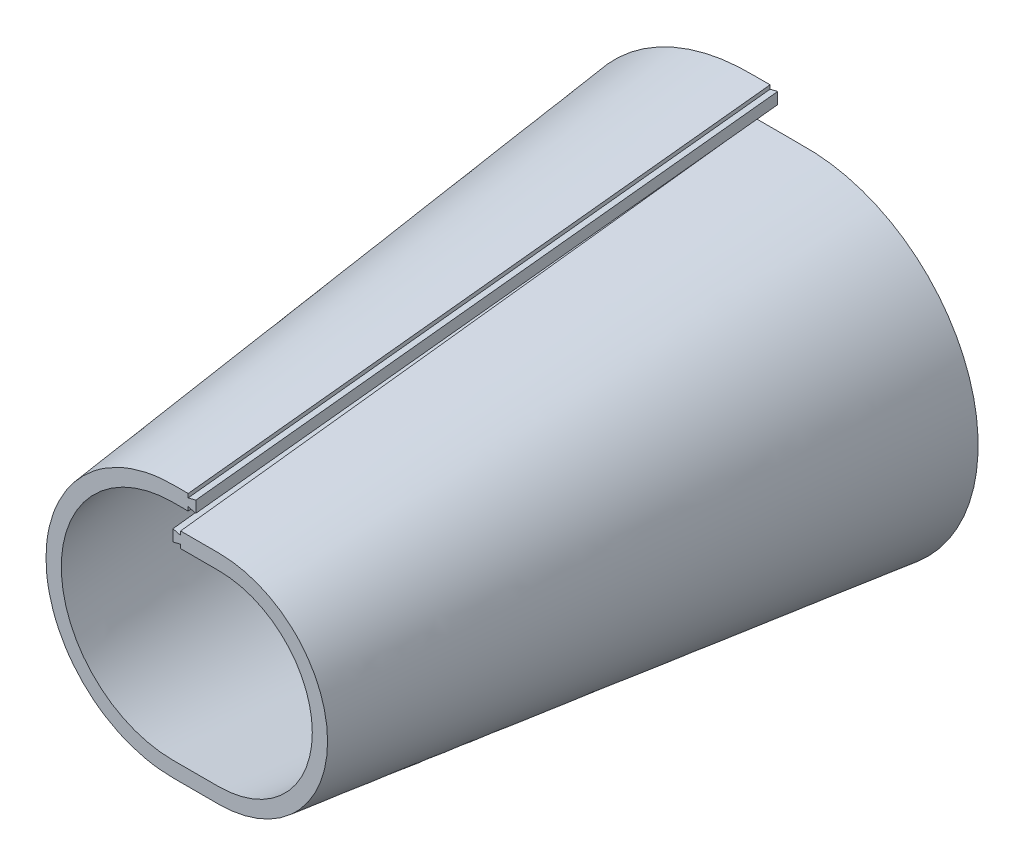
ISO-10303-21;
HEADER;
FILE_DESCRIPTION(('STEP AP214'),'2;1');
FILE_NAME('part.step','',(''),(''),'','','');
FILE_SCHEMA(('AUTOMOTIVE_DESIGN { 1 0 10303 214 1 1 1 1 }'));
ENDSEC;
DATA;
#1=APPLICATION_CONTEXT('core data for automotive mechanical design processes');
#2=APPLICATION_PROTOCOL_DEFINITION('international standard','automotive_design',2000,#1);
#3=PRODUCT_CONTEXT('',#1,'mechanical');
#4=PRODUCT('Part','Part','',(#3));
#5=PRODUCT_RELATED_PRODUCT_CATEGORY('part','',(#4));
#6=PRODUCT_DEFINITION_FORMATION('','',#4);
#7=PRODUCT_DEFINITION_CONTEXT('part definition',#1,'design');
#8=PRODUCT_DEFINITION('design','',#6,#7);
#9=PRODUCT_DEFINITION_SHAPE('','',#8);
#10=(LENGTH_UNIT() NAMED_UNIT(*) SI_UNIT(.MILLI.,.METRE.));
#11=(NAMED_UNIT(*) PLANE_ANGLE_UNIT() SI_UNIT($,.RADIAN.));
#12=(NAMED_UNIT(*) SI_UNIT($,.STERADIAN.) SOLID_ANGLE_UNIT());
#13=UNCERTAINTY_MEASURE_WITH_UNIT(LENGTH_MEASURE(1.E-05),#10,'distance_accuracy_value','');
#14=(GEOMETRIC_REPRESENTATION_CONTEXT(3) GLOBAL_UNCERTAINTY_ASSIGNED_CONTEXT((#13)) GLOBAL_UNIT_ASSIGNED_CONTEXT((#10,
#11,#12)) REPRESENTATION_CONTEXT('',''));
#15=CARTESIAN_POINT('',(0.,0.,0.));
#16=DIRECTION('',(0.,0.,1.));
#17=DIRECTION('',(1.,0.,0.));
#18=AXIS2_PLACEMENT_3D('',#15,#16,#17);
#19=CARTESIAN_POINT('',(6.,0.,0.));
#20=DIRECTION('',(0.,0.,-1.));
#21=DIRECTION('',(-1.,0.,0.));
#22=AXIS2_PLACEMENT_3D('',#19,#20,#21);
#23=PLANE('',#22);
#24=DIRECTION('',(0.,-1.,0.));
#25=VECTOR('',#24,1.);
#26=CARTESIAN_POINT('',(-6.,28.5,0.));
#27=LINE('',#26,#25);
#28=CARTESIAN_POINT('',(-6.,28.,0.));
#29=VERTEX_POINT('',#28);
#30=CARTESIAN_POINT('',(-6.,25.,0.));
#31=VERTEX_POINT('',#30);
#32=EDGE_CURVE('E487',#29,#31,#27,.T.);
#33=ORIENTED_EDGE('',*,*,#32,.T.);
#34=DIRECTION('',(-0.970142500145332,-0.242535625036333,0.));
#35=VECTOR('',#34,1.);
#36=CARTESIAN_POINT('',(-4.,25.5,0.));
#37=LINE('',#36,#35);
#38=CARTESIAN_POINT('',(-4.,25.5,0.));
#39=VERTEX_POINT('',#38);
#40=EDGE_CURVE('E392',#39,#31,#37,.T.);
#41=ORIENTED_EDGE('',*,*,#40,.F.);
#42=DIRECTION('',(0.,1.,0.));
#43=VECTOR('',#42,1.);
#44=CARTESIAN_POINT('',(-4.,24.5,0.));
#45=LINE('',#44,#43);
#46=CARTESIAN_POINT('',(-4.,24.5,0.));
#47=VERTEX_POINT('',#46);
#48=EDGE_CURVE('E390',#47,#39,#45,.T.);
#49=ORIENTED_EDGE('',*,*,#48,.F.);
#50=DIRECTION('',(1.,0.,0.));
#51=VECTOR('',#50,1.);
#52=CARTESIAN_POINT('',(-6.,24.5,0.));
#53=LINE('',#52,#51);
#54=CARTESIAN_POINT('',(6.,24.5,0.));
#55=VERTEX_POINT('',#54);
#56=EDGE_CURVE('E518',#47,#55,#53,.T.);
#57=ORIENTED_EDGE('',*,*,#56,.T.);
#58=CARTESIAN_POINT('',(6.,0.,0.));
#59=DIRECTION('',(0.,0.,-1.));
#60=DIRECTION('',(-1.,0.,0.));
#61=AXIS2_PLACEMENT_3D('',#58,#59,#60);
#62=CIRCLE('',#61,24.5);
#63=CARTESIAN_POINT('',(6.00000000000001,-24.5,0.));
#64=VERTEX_POINT('',#63);
#65=EDGE_CURVE('E520',#55,#64,#62,.T.);
#66=ORIENTED_EDGE('',*,*,#65,.T.);
#67=DIRECTION('',(-1.,0.,0.));
#68=VECTOR('',#67,1.);
#69=CARTESIAN_POINT('',(6.,-24.5,0.));
#70=LINE('',#69,#68);
#71=CARTESIAN_POINT('',(-5.99999999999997,-24.5,0.));
#72=VERTEX_POINT('',#71);
#73=EDGE_CURVE('E708',#64,#72,#70,.T.);
#74=ORIENTED_EDGE('',*,*,#73,.T.);
#75=CARTESIAN_POINT('',(-6.,4.75,0.));
#76=DIRECTION('',(0.,0.,-1.));
#77=DIRECTION('',(-1.,0.,0.));
#78=AXIS2_PLACEMENT_3D('',#75,#76,#77);
#79=CIRCLE('',#78,29.25);
#80=CARTESIAN_POINT('',(-6.00000000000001,34.,0.));
#81=VERTEX_POINT('',#80);
#82=EDGE_CURVE('E696',#72,#81,#79,.T.);
#83=ORIENTED_EDGE('',*,*,#82,.T.);
#84=DIRECTION('',(-1.,0.,0.));
#85=VECTOR('',#84,1.);
#86=CARTESIAN_POINT('',(0.,34.,0.));
#87=LINE('',#86,#85);
#88=CARTESIAN_POINT('',(-2.,34.,0.));
#89=VERTEX_POINT('',#88);
#90=EDGE_CURVE('E694',#89,#81,#87,.T.);
#91=ORIENTED_EDGE('',*,*,#90,.F.);
#92=DIRECTION('',(0.,-1.,0.));
#93=VECTOR('',#92,1.);
#94=CARTESIAN_POINT('',(-2.,0.,0.));
#95=LINE('',#94,#93);
#96=CARTESIAN_POINT('',(-2.,35.,0.));
#97=VERTEX_POINT('',#96);
#98=EDGE_CURVE('E418',#97,#89,#95,.T.);
#99=ORIENTED_EDGE('',*,*,#98,.F.);
#100=DIRECTION('',(-0.970142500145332,0.242535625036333,0.));
#101=VECTOR('',#100,1.);
#102=CARTESIAN_POINT('',(8.11764705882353,32.4705882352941,0.));
#103=LINE('',#102,#101);
#104=CARTESIAN_POINT('',(0.,34.5,0.));
#105=VERTEX_POINT('',#104);
#106=EDGE_CURVE('E683',#105,#97,#103,.T.);
#107=ORIENTED_EDGE('',*,*,#106,.F.);
#108=DIRECTION('',(0.,-1.,0.));
#109=VECTOR('',#108,1.);
#110=CARTESIAN_POINT('',(0.,38.,0.));
#111=LINE('',#110,#109);
#112=CARTESIAN_POINT('',(0.,37.5,0.));
#113=VERTEX_POINT('',#112);
#114=EDGE_CURVE('E615',#113,#105,#111,.T.);
#115=ORIENTED_EDGE('',*,*,#114,.F.);
#116=DIRECTION('',(-0.970142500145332,-0.242535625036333,0.));
#117=VECTOR('',#116,1.);
#118=CARTESIAN_POINT('',(0.,37.5,0.));
#119=LINE('',#118,#117);
#120=CARTESIAN_POINT('',(-2.,37.,0.));
#121=VERTEX_POINT('',#120);
#122=EDGE_CURVE('E421',#113,#121,#119,.T.);
#123=ORIENTED_EDGE('',*,*,#122,.T.);
#124=DIRECTION('',(0.,-1.,0.));
#125=VECTOR('',#124,1.);
#126=CARTESIAN_POINT('',(-2.,38.,0.));
#127=LINE('',#126,#125);
#128=CARTESIAN_POINT('',(-2.,38.,0.));
#129=VERTEX_POINT('',#128);
#130=EDGE_CURVE('E435',#129,#121,#127,.T.);
#131=ORIENTED_EDGE('',*,*,#130,.F.);
#132=DIRECTION('',(1.,0.,0.));
#133=VECTOR('',#132,1.);
#134=CARTESIAN_POINT('',(-6.,38.,0.));
#135=LINE('',#134,#133);
#136=CARTESIAN_POINT('',(-6.,38.,0.));
#137=VERTEX_POINT('',#136);
#138=EDGE_CURVE('E633',#137,#129,#135,.T.);
#139=ORIENTED_EDGE('',*,*,#138,.F.);
#140=CARTESIAN_POINT('',(-6.,4.75,0.));
#141=DIRECTION('',(0.,0.,-1.));
#142=DIRECTION('',(-1.,0.,0.));
#143=AXIS2_PLACEMENT_3D('',#140,#141,#142);
#144=CIRCLE('',#143,33.25);
#145=CARTESIAN_POINT('',(-6.,-28.5,0.));
#146=VERTEX_POINT('',#145);
#147=EDGE_CURVE('E636',#146,#137,#144,.T.);
#148=ORIENTED_EDGE('',*,*,#147,.F.);
#149=DIRECTION('',(1.,0.,0.));
#150=VECTOR('',#149,1.);
#151=CARTESIAN_POINT('',(-6.,-28.5,0.));
#152=LINE('',#151,#150);
#153=CARTESIAN_POINT('',(6.,-28.5,0.));
#154=VERTEX_POINT('',#153);
#155=EDGE_CURVE('E768',#146,#154,#152,.T.);
#156=ORIENTED_EDGE('',*,*,#155,.T.);
#157=CARTESIAN_POINT('',(6.,0.,0.));
#158=DIRECTION('',(0.,0.,-1.));
#159=DIRECTION('',(-1.,0.,0.));
#160=AXIS2_PLACEMENT_3D('',#157,#158,#159);
#161=CIRCLE('',#160,28.5);
#162=CARTESIAN_POINT('',(6.,28.5,0.));
#163=VERTEX_POINT('',#162);
#164=EDGE_CURVE('E497',#163,#154,#161,.T.);
#165=ORIENTED_EDGE('',*,*,#164,.F.);
#166=DIRECTION('',(1.,0.,0.));
#167=VECTOR('',#166,1.);
#168=CARTESIAN_POINT('',(-6.,28.5,0.));
#169=LINE('',#168,#167);
#170=CARTESIAN_POINT('',(-3.99999999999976,28.5,0.));
#171=VERTEX_POINT('',#170);
#172=EDGE_CURVE('E494',#171,#163,#169,.T.);
#173=ORIENTED_EDGE('',*,*,#172,.F.);
#174=DIRECTION('',(0.,1.,0.));
#175=VECTOR('',#174,1.);
#176=CARTESIAN_POINT('',(-4.,28.5,0.));
#177=LINE('',#176,#175);
#178=CARTESIAN_POINT('',(-4.,27.5,0.));
#179=VERTEX_POINT('',#178);
#180=EDGE_CURVE('E285',#179,#171,#177,.T.);
#181=ORIENTED_EDGE('',*,*,#180,.F.);
#182=DIRECTION('',(0.970142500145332,-0.242535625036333,0.));
#183=VECTOR('',#182,1.);
#184=CARTESIAN_POINT('',(-4.,27.5,0.));
#185=LINE('',#184,#183);
#186=EDGE_CURVE('E491',#29,#179,#185,.T.);
#187=ORIENTED_EDGE('',*,*,#186,.F.);
#188=EDGE_LOOP('',(#33,#41,#49,#57,#66,#74,#83,#91,#99,#107,#115,#123,#131,#139,#148,#156,#165,
#173,#181,#187));
#189=FACE_BOUND('',#188,.T.);
#190=ADVANCED_FACE('F260',(#189),#23,.F.);
#191=CARTESIAN_POINT('',(0.,56.,-203.2));
#192=DIRECTION('',(1.,0.,0.));
#193=DIRECTION('',(0.,1.,0.));
#194=AXIS2_PLACEMENT_3D('',#191,#192,#193);
#195=PLANE('',#194);
#196=DIRECTION('',(0.,-1.,0.));
#197=VECTOR('',#196,1.);
#198=CARTESIAN_POINT('',(0.,56.,-152.4));
#199=LINE('',#198,#197);
#200=CARTESIAN_POINT('',(0.,54.,-152.4));
#201=VERTEX_POINT('',#200);
#202=CARTESIAN_POINT('',(0.,51.,-152.4));
#203=VERTEX_POINT('',#202);
#204=EDGE_CURVE('E395',#201,#203,#199,.T.);
#205=ORIENTED_EDGE('',*,*,#204,.F.);
#206=DIRECTION('',(0.,-0.107638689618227,0.994190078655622));
#207=VECTOR('',#206,1.);
#208=CARTESIAN_POINT('',(0.,59.3721817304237,-202.019423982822));
#209=LINE('',#208,#207);
#210=EDGE_CURVE('E498',#201,#113,#209,.T.);
#211=ORIENTED_EDGE('',*,*,#210,.T.);
#212=ORIENTED_EDGE('',*,*,#114,.T.);
#213=DIRECTION('',(0.,-0.107638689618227,0.994190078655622));
#214=VECTOR('',#213,1.);
#215=CARTESIAN_POINT('',(0.,56.3721817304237,-202.019423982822));
#216=LINE('',#215,#214);
#217=EDGE_CURVE('E408',#203,#105,#216,.T.);
#218=ORIENTED_EDGE('',*,*,#217,.F.);
#219=EDGE_LOOP('',(#205,#211,#212,#218));
#220=FACE_BOUND('',#219,.T.);
#221=ADVANCED_FACE('F460',(#220),#195,.T.);
#222=CARTESIAN_POINT('',(-8.0000026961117,50.5,-203.2));
#223=DIRECTION('',(-0.999951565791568,0.,0.00984205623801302));
#224=DIRECTION('',(0.,-1.,0.));
#225=AXIS2_PLACEMENT_3D('',#222,#223,#224);
#226=PLANE('',#225);
#227=DIRECTION('',(0.,1.,0.));
#228=VECTOR('',#227,1.);
#229=CARTESIAN_POINT('',(-7.50000202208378,50.5,-152.4));
#230=LINE('',#229,#228);
#231=CARTESIAN_POINT('',(-7.50000202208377,41.5,-152.4));
#232=VERTEX_POINT('',#231);
#233=CARTESIAN_POINT('',(-7.50000202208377,44.5,-152.4));
#234=VERTEX_POINT('',#233);
#235=EDGE_CURVE('E673',#232,#234,#230,.T.);
#236=ORIENTED_EDGE('',*,*,#235,.F.);
#237=DIRECTION('',(0.00978488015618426,-0.107633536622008,0.994142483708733));
#238=VECTOR('',#237,1.);
#239=CARTESIAN_POINT('',(-8.01667693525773,47.1834163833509,-204.894100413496));
#240=LINE('',#239,#238);
#241=EDGE_CURVE('E386',#232,#31,#240,.T.);
#242=ORIENTED_EDGE('',*,*,#241,.T.);
#243=ORIENTED_EDGE('',*,*,#32,.F.);
#244=DIRECTION('',(0.00978488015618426,-0.107633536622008,0.994142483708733));
#245=VECTOR('',#244,1.);
#246=CARTESIAN_POINT('',(-8.01667693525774,50.1834163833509,-204.894100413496));
#247=LINE('',#246,#245);
#248=EDGE_CURVE('E406',#234,#29,#247,.T.);
#249=ORIENTED_EDGE('',*,*,#248,.F.);
#250=EDGE_LOOP('',(#236,#242,#243,#249));
#251=FACE_BOUND('',#250,.T.);
#252=ADVANCED_FACE('F455',(#251),#226,.T.);
#253=CARTESIAN_POINT('',(-8.0000026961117,46.5,-203.2));
#254=CARTESIAN_POINT('',(-6.,24.5,0.));
#255=CARTESIAN_POINT('',(-6.66666891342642,46.5,-203.2));
#256=CARTESIAN_POINT('',(-5.,24.5,0.));
#257=CARTESIAN_POINT('',(-4.09572589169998,46.5,-203.2));
#258=CARTESIAN_POINT('',(-2.91580251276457,24.5,0.));
#259=CARTESIAN_POINT('',(-0.308494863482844,46.5,-203.2));
#260=CARTESIAN_POINT('',(0.279469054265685,24.5,0.));
#261=CARTESIAN_POINT('',(3.59784489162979,46.5,-203.2));
#262=CARTESIAN_POINT('',(3.31274528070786,24.5,0.));
#263=CARTESIAN_POINT('',(6.43173953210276,46.5,-203.2));
#264=CARTESIAN_POINT('',(5.13916992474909,24.5,0.));
#265=CARTESIAN_POINT('',(10.9846882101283,46.5,-203.2));
#266=CARTESIAN_POINT('',(7.63831371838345,24.5,0.));
#267=CARTESIAN_POINT('',(16.9755321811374,45.9234953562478,-203.2));
#268=CARTESIAN_POINT('',(10.9003702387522,24.1695376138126,0.));
#269=CARTESIAN_POINT('',(25.6822101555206,43.3265250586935,-203.2));
#270=CARTESIAN_POINT('',(15.5681450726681,22.7302520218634,0.));
#271=CARTESIAN_POINT('',(33.7649761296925,39.0678611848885,-203.199999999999));
#272=CARTESIAN_POINT('',(19.8315184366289,20.4111263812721,0.));
#273=CARTESIAN_POINT('',(40.8966170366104,33.2893418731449,-203.200000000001));
#274=CARTESIAN_POINT('',(23.5475027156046,17.3252330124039,0.));
#275=CARTESIAN_POINT('',(46.7823679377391,26.2008072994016,-203.199999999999));
#276=CARTESIAN_POINT('',(26.5731102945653,13.5856442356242,0.));
#277=CARTESIAN_POINT('',(51.1751653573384,18.0719287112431,-203.200000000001));
#278=CARTESIAN_POINT('',(28.8172757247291,9.34591590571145,0.));
#279=CARTESIAN_POINT('',(53.8884078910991,9.22090373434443,-203.199999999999));
#280=CARTESIAN_POINT('',(30.1889335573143,4.75960387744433,0.));
#281=CARTESIAN_POINT('',(54.8059668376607,0.,-203.200000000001));
#282=CARTESIAN_POINT('',(30.6566355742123,0.,0.));
#283=CARTESIAN_POINT('',(53.888407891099,-9.22090373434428,-203.2));
#284=CARTESIAN_POINT('',(30.1889335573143,-4.75960387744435,0.));
#285=CARTESIAN_POINT('',(51.1751653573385,-18.0719287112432,-203.2));
#286=CARTESIAN_POINT('',(28.8172757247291,-9.3459159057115,0.));
#287=CARTESIAN_POINT('',(46.7823679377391,-26.2008072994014,-203.2));
#288=CARTESIAN_POINT('',(26.5731102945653,-13.5856442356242,0.));
#289=CARTESIAN_POINT('',(40.8966170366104,-33.2893418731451,-203.2));
#290=CARTESIAN_POINT('',(23.5475027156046,-17.3252330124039,0.));
#291=CARTESIAN_POINT('',(33.7649761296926,-39.0678611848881,-203.2));
#292=CARTESIAN_POINT('',(19.8315184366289,-20.4111263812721,0.));
#293=CARTESIAN_POINT('',(25.6822101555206,-43.3265250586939,-203.2));
#294=CARTESIAN_POINT('',(15.5681450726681,-22.7302520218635,0.));
#295=CARTESIAN_POINT('',(16.9755321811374,-45.9234953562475,-203.2));
#296=CARTESIAN_POINT('',(10.9003702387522,-24.1695376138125,0.));
#297=CARTESIAN_POINT('',(10.9846882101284,-46.5,-203.2));
#298=CARTESIAN_POINT('',(7.63831371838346,-24.5,0.));
#299=CARTESIAN_POINT('',(6.43173953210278,-46.5,-203.2));
#300=CARTESIAN_POINT('',(5.13916992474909,-24.5,0.));
#301=CARTESIAN_POINT('',(3.70234119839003,-46.5,-203.2));
#302=CARTESIAN_POINT('',(3.27202143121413,-24.5,0.));
#303=CARTESIAN_POINT('',(-0.0567391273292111,-46.5,-203.2));
#304=CARTESIAN_POINT('',(0.0715079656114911,-24.5,0.));
#305=CARTESIAN_POINT('',(-3.79475820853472,-46.5,-203.2));
#306=CARTESIAN_POINT('',(-3.17887480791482,-24.5,0.));
#307=CARTESIAN_POINT('',(-6.48231096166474,-46.5,-203.2));
#308=CARTESIAN_POINT('',(-5.10921189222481,-24.5,0.));
#309=CARTESIAN_POINT('',(-11.3082178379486,-46.5,-203.2));
#310=CARTESIAN_POINT('',(-7.94171098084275,-24.5,0.));
#311=CARTESIAN_POINT('',(-17.9389536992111,-45.8574326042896,-203.2));
#312=CARTESIAN_POINT('',(-11.8159099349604,-24.1121910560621,0.));
#313=CARTESIAN_POINT('',(-27.5485194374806,-42.9782308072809,-203.2));
#314=CARTESIAN_POINT('',(-17.3767785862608,-22.4040791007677,0.));
#315=CARTESIAN_POINT('',(-36.4473942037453,-38.2742933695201,-203.2));
#316=CARTESIAN_POINT('',(-22.4753338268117,-19.647465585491,0.));
#317=CARTESIAN_POINT('',(-44.284128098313,-31.9104183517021,-203.2));
#318=CARTESIAN_POINT('',(-26.9250587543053,-15.958121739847,0.));
#319=CARTESIAN_POINT('',(-50.7448372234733,-24.1213100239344,-203.2));
#320=CARTESIAN_POINT('',(-30.5566586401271,-11.4815852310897,0.));
#321=CARTESIAN_POINT('',(-55.5678194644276,-15.2022402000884,-203.2));
#322=CARTESIAN_POINT('',(-33.2484489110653,-6.39484062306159,0.));
#323=CARTESIAN_POINT('',(-58.5555098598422,-5.49749680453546,-203.2));
#324=CARTESIAN_POINT('',(-34.8889795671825,-0.888154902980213,0.));
#325=CARTESIAN_POINT('',(-59.5839066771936,4.61412004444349,-203.2));
#326=CARTESIAN_POINT('',(-35.4391392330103,4.82610293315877,0.));
#327=CARTESIAN_POINT('',(-58.6085154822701,14.7353819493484,-203.2));
#328=CARTESIAN_POINT('',(-34.8598165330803,10.5355638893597,0.));
#329=CARTESIAN_POINT('',(-55.6667024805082,24.4678154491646,-203.2));
#330=CARTESIAN_POINT('',(-33.1934076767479,16.0276375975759,0.));
#331=CARTESIAN_POINT('',(-50.8761339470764,33.4290172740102,-203.2));
#332=CARTESIAN_POINT('',(-30.4823088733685,21.0897336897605,0.));
#333=CARTESIAN_POINT('',(-44.4295463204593,41.2690926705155,-203.2));
#334=CARTESIAN_POINT('',(-26.8438906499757,25.5403565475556,0.));
#335=CARTESIAN_POINT('',(-36.5858926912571,47.6857415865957,-203.2));
#336=CARTESIAN_POINT('',(-22.395523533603,29.1980105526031,0.));
#337=CARTESIAN_POINT('',(-27.6587513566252,52.4364974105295,-203.2));
#338=CARTESIAN_POINT('',(-17.3134548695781,31.929100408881,0.));
#339=CARTESIAN_POINT('',(-18.0018543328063,55.3489111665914,-203.2));
#340=CARTESIAN_POINT('',(-11.7787918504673,33.6171031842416,0.));
#341=CARTESIAN_POINT('',(-11.3300127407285,56.,-203.2));
#342=CARTESIAN_POINT('',(-7.92879988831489,34.,0.));
#343=CARTESIAN_POINT('',(-7.23615746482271,56.,-203.2));
#344=CARTESIAN_POINT('',(-5.5575675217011,34.,0.));
#345=CARTESIAN_POINT('',(-5.82907928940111,55.9999999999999,-203.2));
#346=CARTESIAN_POINT('',(-4.62688941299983,34.,0.));
#347=CARTESIAN_POINT('',(-3.86810443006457,56.0000000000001,-203.2));
#348=CARTESIAN_POINT('',(-3.11109981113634,34.,0.));
#349=CARTESIAN_POINT('',(-1.95905112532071,56.,-203.2));
#350=CARTESIAN_POINT('',(-1.53360102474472,34.,0.));
#351=CARTESIAN_POINT('',(-0.666666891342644,56.,-203.2));
#352=CARTESIAN_POINT('',(-0.5,34.,0.));
#353=CARTESIAN_POINT('',(0.,56.,-203.2));
#354=CARTESIAN_POINT('',(0.,34.,0.));
#355=B_SPLINE_SURFACE_WITH_KNOTS('',3,1,((#253,#254),(#255,#256),(#257,#258),(#259,#260),(#261,
#262),(#263,#264),(#265,#266),(#267,#268),(#269,#270),(#271,#272),(#273,#274),(#275,#276),(#277,
#278),(#279,#280),(#281,#282),(#283,#284),(#285,#286),(#287,#288),(#289,#290),(#291,#292),(#293,
#294),(#295,#296),(#297,#298),(#299,#300),(#301,#302),(#303,#304),(#305,#306),(#307,#308),(#309,
#310),(#311,#312),(#313,#314),(#315,#316),(#317,#318),(#319,#320),(#321,#322),(#323,#324),(#325,
#326),(#327,#328),(#329,#330),(#331,#332),(#333,#334),(#335,#336),(#337,#338),(#339,#340),(#341,
#342),(#343,#344),(#345,#346),(#347,#348),(#349,#350),(#351,#352),(#353,#354)),.UNSPECIFIED.,
.F.,.F.,.F.,(4,1,1,1,2,1,1,1,1,1,1,1,1,1,1,1,1,1,1,1,2,1,1,1,2,1,1,1,1,1,1,1,1,1,1,1,1,1,1,1,2,
1,1,1,4),(2,2),(0.,0.0132754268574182,0.0265508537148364,0.0398262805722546,0.0531017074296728,
0.0783672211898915,0.10363273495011,0.128898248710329,0.154163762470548,0.179429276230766,
0.204694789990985,0.229960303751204,0.255225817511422,0.280491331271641,0.30575684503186,
0.331022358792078,0.356287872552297,0.381553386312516,0.406818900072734,0.432084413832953,
0.457349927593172,0.47062535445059,0.483900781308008,0.497176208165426,0.510451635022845,
0.53938897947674,0.568326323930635,0.597263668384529,0.626201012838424,0.655138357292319,
0.684075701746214,0.713013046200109,0.741950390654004,0.770887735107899,0.799825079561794,
0.828762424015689,0.857699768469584,0.886637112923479,0.915574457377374,0.944511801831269,
0.973449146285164,0.980086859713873,0.986724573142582,0.993362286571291,1.),(0.,1.),.UNSPECIFIED.);
#356=CARTESIAN_POINT('',(0.,50.5,-152.4));
#357=CARTESIAN_POINT('',(-0.245364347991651,50.5000000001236,-152.4));
#358=CARTESIAN_POINT('',(-0.490728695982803,50.5000000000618,-152.4));
#359=CARTESIAN_POINT('',(-0.981457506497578,50.4999999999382,-152.4));
#360=CARTESIAN_POINT('',(-1.2268219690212,50.4999999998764,-152.4));
#361=CARTESIAN_POINT('',(-1.71841675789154,50.5000000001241,-152.4));
#362=CARTESIAN_POINT('',(-1.96464708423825,50.5000000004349,-152.4));
#363=CARTESIAN_POINT('',(-2.4571076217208,50.4999999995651,-152.4));
#364=CARTESIAN_POINT('',(-2.70333783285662,50.4999999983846,-152.4));
#365=CARTESIAN_POINT('',(-3.19642672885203,50.5000000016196,-152.4));
#366=CARTESIAN_POINT('',(-3.44328541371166,50.5000000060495,-152.4));
#367=CARTESIAN_POINT('',(-3.93700313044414,50.4999999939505,-152.4));
#368=CARTESIAN_POINT('',(-4.18386216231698,50.4999999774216,-152.4));
#369=CARTESIAN_POINT('',(-4.67797200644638,50.5000000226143,-152.4));
#370=CARTESIAN_POINT('',(-4.92522281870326,50.5000000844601,-152.4));
#371=CARTESIAN_POINT('',(-5.41972316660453,50.4999999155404,-152.4));
#372=CARTESIAN_POINT('',(-5.66697270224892,50.4999996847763,-152.4));
#373=CARTESIAN_POINT('',(-6.03792325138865,50.500000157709,-152.4));
#374=CARTESIAN_POINT('',(-6.16162426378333,50.5000004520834,-152.4));
#375=CARTESIAN_POINT('',(-6.40902609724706,50.4999995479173,-152.4));
#376=CARTESIAN_POINT('',(-6.5327269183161,50.499998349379,-152.4));
#377=CARTESIAN_POINT('',(-6.78013070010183,50.5000016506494,-152.4));
#378=CARTESIAN_POINT('',(-6.90383366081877,50.5000061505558,-152.4));
#379=CARTESIAN_POINT('',(-7.15124022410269,50.4999938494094,-152.4));
#380=CARTESIAN_POINT('',(-7.27494382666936,50.4999770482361,-152.4));
#381=CARTESIAN_POINT('',(-7.46048633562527,50.5000114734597,-152.4));
#382=CARTESIAN_POINT('',(-7.52232516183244,50.5000328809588,-152.4));
#383=CARTESIAN_POINT('',(-7.64600227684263,50.4998118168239,-152.4));
#384=CARTESIAN_POINT('',(-7.70784056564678,50.4995693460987,-152.4));
#385=CARTESIAN_POINT('',(-7.83151488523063,50.4988363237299,-152.4));
#386=CARTESIAN_POINT('',(-7.89335091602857,50.4983457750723,-152.4));
#387=CARTESIAN_POINT('',(-8.01702064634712,50.497112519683,-152.4));
#388=CARTESIAN_POINT('',(-8.07885434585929,50.4963698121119,-152.4));
#389=CARTESIAN_POINT('',(-8.26434458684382,50.4937652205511,-152.4));
#390=CARTESIAN_POINT('',(-8.38799605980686,50.4915268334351,-152.4));
#391=CARTESIAN_POINT('',(-8.63527808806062,50.4860460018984,-152.4));
#392=CARTESIAN_POINT('',(-8.75890864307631,50.4828035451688,-152.4));
#393=CARTESIAN_POINT('',(-9.00705490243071,50.4752878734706,-152.4));
#394=CARTESIAN_POINT('',(-9.13157038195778,50.4710072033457,-152.4));
#395=CARTESIAN_POINT('',(-9.38056118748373,50.461428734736,-152.4));
#396=CARTESIAN_POINT('',(-9.50503651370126,50.4561309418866,-152.4));
#397=CARTESIAN_POINT('',(-9.87840260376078,50.4387125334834,-152.4));
#398=CARTESIAN_POINT('',(-10.1272240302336,50.4250671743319,-152.4));
#399=CARTESIAN_POINT('',(-10.624241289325,50.3937405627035,-152.4));
#400=CARTESIAN_POINT('',(-10.872437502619,50.3760653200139,-152.4));
#401=CARTESIAN_POINT('',(-11.3685042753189,50.3366745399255,-152.4));
#402=CARTESIAN_POINT('',(-11.6163748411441,50.3149590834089,-152.4));
#403=CARTESIAN_POINT('',(-12.1114662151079,50.2675191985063,-152.4));
#404=CARTESIAN_POINT('',(-12.3586874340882,50.2417990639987,-152.4));
#405=CARTESIAN_POINT('',(-12.8526780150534,50.1863397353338,-152.4));
#406=CARTESIAN_POINT('',(-13.0994473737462,50.1566005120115,-152.4));
#407=CARTESIAN_POINT('',(-13.8386406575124,50.0614067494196,-152.4));
#408=CARTESIAN_POINT('',(-14.3303045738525,49.9899421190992,-152.4));
#409=CARTESIAN_POINT('',(-15.3108950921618,49.8310573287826,-152.4));
#410=CARTESIAN_POINT('',(-15.7998224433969,49.7436417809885,-152.4));
#411=CARTESIAN_POINT('',(-16.7746056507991,49.5528797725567,-152.4));
#412=CARTESIAN_POINT('',(-17.2604611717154,49.4495316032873,-152.4));
#413=CARTESIAN_POINT('',(-18.484806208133,49.1681672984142,-152.4));
#414=CARTESIAN_POINT('',(-19.2208940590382,48.9795838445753,-152.4));
#415=CARTESIAN_POINT('',(-20.6836205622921,48.5658221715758,-152.4));
#416=CARTESIAN_POINT('',(-21.4102470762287,48.3406011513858,-152.4));
#417=CARTESIAN_POINT('',(-22.8518517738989,47.8541110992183,-152.4));
#418=CARTESIAN_POINT('',(-23.5668223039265,47.5928193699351,-152.4));
#419=CARTESIAN_POINT('',(-24.9828754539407,47.0347685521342,-152.4));
#420=CARTESIAN_POINT('',(-25.6839565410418,46.7380055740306,-152.4));
#421=CARTESIAN_POINT('',(-27.0680056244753,46.1109358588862,-152.4));
#422=CARTESIAN_POINT('',(-27.751028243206,45.7807496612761,-152.4));
#423=CARTESIAN_POINT('',(-29.0995327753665,45.0870603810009,-152.4));
#424=CARTESIAN_POINT('',(-29.7650227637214,44.7235729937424,-152.4));
#425=CARTESIAN_POINT('',(-31.0769488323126,43.964156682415,-152.4));
#426=CARTESIAN_POINT('',(-31.7233909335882,43.5682381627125,-152.4));
#427=CARTESIAN_POINT('',(-32.9956596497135,42.7447962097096,-152.4));
#428=CARTESIAN_POINT('',(-33.6214896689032,42.3172780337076,-152.4));
#429=CARTESIAN_POINT('',(-34.9318663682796,41.3735495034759,-152.4));
#430=CARTESIAN_POINT('',(-35.613339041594,40.8530628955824,-152.4));
#431=CARTESIAN_POINT('',(-36.9460418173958,39.7746946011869,-152.4));
#432=CARTESIAN_POINT('',(-37.5972710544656,39.2168118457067,-152.4));
#433=CARTESIAN_POINT('',(-38.8673483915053,38.065323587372,-152.4));
#434=CARTESIAN_POINT('',(-39.4861965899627,37.4717181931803,-152.4));
#435=CARTESIAN_POINT('',(-40.6899570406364,36.2499968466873,-152.4));
#436=CARTESIAN_POINT('',(-41.2748385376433,35.6218505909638,-152.4));
#437=CARTESIAN_POINT('',(-42.4083887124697,34.333710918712,-152.4));
#438=CARTESIAN_POINT('',(-42.9570575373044,33.673717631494,-152.4));
#439=CARTESIAN_POINT('',(-44.0165154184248,32.3239653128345,-152.4));
#440=CARTESIAN_POINT('',(-44.5273045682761,31.6342063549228,-152.4));
#441=CARTESIAN_POINT('',(-45.3864151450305,30.4030980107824,-152.4));
#442=CARTESIAN_POINT('',(-45.7434175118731,29.8677808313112,-152.4));
#443=CARTESIAN_POINT('',(-46.4345454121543,28.7825119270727,-152.4));
#444=CARTESIAN_POINT('',(-46.7686694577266,28.232559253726,-152.4));
#445=CARTESIAN_POINT('',(-47.4134605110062,27.1190967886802,-152.4));
#446=CARTESIAN_POINT('',(-47.7241281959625,26.5555873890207,-152.4));
#447=CARTESIAN_POINT('',(-48.3214564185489,25.4159969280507,-152.4));
#448=CARTESIAN_POINT('',(-48.6081173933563,24.839916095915,-152.4));
#449=CARTESIAN_POINT('',(-49.1567731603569,23.6764169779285,-152.4));
#450=CARTESIAN_POINT('',(-49.4187781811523,23.0890035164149,-152.4));
#451=CARTESIAN_POINT('',(-49.9176780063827,21.9036092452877,-152.4));
#452=CARTESIAN_POINT('',(-50.1545727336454,21.3056284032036,-152.4));
#453=CARTESIAN_POINT('',(-50.6029100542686,20.1001894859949,-152.4));
#454=CARTESIAN_POINT('',(-50.8143526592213,19.4927314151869,-152.4));
#455=CARTESIAN_POINT('',(-51.2114707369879,18.2694967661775,-152.4));
#456=CARTESIAN_POINT('',(-51.3971461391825,17.6537201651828,-152.4));
#457=CARTESIAN_POINT('',(-51.9149459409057,15.795808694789,-152.4));
#458=CARTESIAN_POINT('',(-52.2080517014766,14.5425331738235,-152.4));
#459=CARTESIAN_POINT('',(-52.6875015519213,12.0159526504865,-152.4));
#460=CARTESIAN_POINT('',(-52.8738457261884,10.7426476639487,-152.4));
#461=CARTESIAN_POINT('',(-53.1389731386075,8.18431337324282,-152.4));
#462=CARTESIAN_POINT('',(-53.2177261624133,6.8992808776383,-152.4));
#463=CARTESIAN_POINT('',(-53.2542481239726,4.97051683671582,-152.4));
#464=CARTESIAN_POINT('',(-53.252816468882,4.32732620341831,-152.4));
#465=CARTESIAN_POINT('',(-53.2227606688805,3.04158257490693,-152.4));
#466=CARTESIAN_POINT('',(-53.1941358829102,2.39902959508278,-152.4));
#467=CARTESIAN_POINT('',(-53.0676716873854,0.473998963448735,-152.4));
#468=CARTESIAN_POINT('',(-52.9292478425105,-0.806141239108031,-152.4));
#469=CARTESIAN_POINT('',(-52.641336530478,-2.71371651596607,-152.4));
#470=CARTESIAN_POINT('',(-52.5319682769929,-3.34754698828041,-152.4));
#471=CARTESIAN_POINT('',(-52.2865646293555,-4.61005981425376,-152.4));
#472=CARTESIAN_POINT('',(-52.1505301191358,-5.23874233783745,-152.4));
#473=CARTESIAN_POINT('',(-51.8521594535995,-6.48951757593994,-152.4));
#474=CARTESIAN_POINT('',(-51.6898359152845,-7.11161329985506,-152.4));
#475=CARTESIAN_POINT('',(-51.3391926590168,-8.34839613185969,-152.4));
#476=CARTESIAN_POINT('',(-51.150871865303,-8.96308293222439,-152.4));
#477=CARTESIAN_POINT('',(-50.5473627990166,-10.7943234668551,-152.4));
#478=CARTESIAN_POINT('',(-50.0935137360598,-11.998535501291,-152.4));
#479=CARTESIAN_POINT('',(-49.4218073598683,-13.5752123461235,-152.4));
#480=CARTESIAN_POINT('',(-49.2482651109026,-13.9671120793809,-152.4));
#481=CARTESIAN_POINT('',(-48.8902596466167,-14.7458106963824,-152.4));
#482=CARTESIAN_POINT('',(-48.7057988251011,-15.1326106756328,-152.4));
#483=CARTESIAN_POINT('',(-48.1361917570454,-16.2850858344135,-152.4));
#484=CARTESIAN_POINT('',(-47.734829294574,-17.0428165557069,-152.4));
#485=CARTESIAN_POINT('',(-46.8902794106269,-18.534553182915,-152.4));
#486=CARTESIAN_POINT('',(-46.4470917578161,-19.268558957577,-152.4));
#487=CARTESIAN_POINT('',(-45.5193901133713,-20.7116341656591,-152.4));
#488=CARTESIAN_POINT('',(-45.0348117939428,-21.4206622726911,-152.4));
#489=CARTESIAN_POINT('',(-44.0265299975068,-22.8103167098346,-152.4));
#490=CARTESIAN_POINT('',(-43.5028267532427,-23.4909432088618,-152.4));
#491=CARTESIAN_POINT('',(-42.4180578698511,-24.821711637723,-152.4));
#492=CARTESIAN_POINT('',(-41.8569932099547,-25.4718543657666,-152.4));
#493=CARTESIAN_POINT('',(-40.6984497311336,-26.7403513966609,-152.4));
#494=CARTESIAN_POINT('',(-40.1009259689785,-27.3586646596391,-152.4));
#495=CARTESIAN_POINT('',(-38.8718730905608,-28.5605420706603,-152.4));
#496=CARTESIAN_POINT('',(-38.2403432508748,-29.1441054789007,-152.4));
#497=CARTESIAN_POINT('',(-36.9454099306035,-30.2748118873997,-152.4));
#498=CARTESIAN_POINT('',(-36.282004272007,-30.8219523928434,-152.4));
#499=CARTESIAN_POINT('',(-34.9281889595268,-31.875954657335,-152.4));
#500=CARTESIAN_POINT('',(-34.2378980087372,-32.3829688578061,-152.4));
#501=CARTESIAN_POINT('',(-32.8299610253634,-33.3573476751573,-152.4));
#502=CARTESIAN_POINT('',(-32.1123169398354,-33.8247151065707,-152.4));
#503=CARTESIAN_POINT('',(-30.6520702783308,-34.7183317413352,-152.4));
#504=CARTESIAN_POINT('',(-29.9094739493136,-35.1445911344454,-152.4));
#505=CARTESIAN_POINT('',(-28.704280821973,-35.7922267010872,-152.4));
#506=CARTESIAN_POINT('',(-28.248918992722,-36.0271727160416,-152.4));
#507=CARTESIAN_POINT('',(-27.3305605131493,-36.4816625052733,-152.4));
#508=CARTESIAN_POINT('',(-26.8675639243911,-36.7012064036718,-152.4));
#509=CARTESIAN_POINT('',(-25.9343669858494,-37.1246563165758,-152.4));
#510=CARTESIAN_POINT('',(-25.4641652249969,-37.3285592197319,-152.4));
#511=CARTESIAN_POINT('',(-24.5169602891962,-37.7204826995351,-152.4));
#512=CARTESIAN_POINT('',(-24.0399543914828,-37.9084966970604,-152.4));
#513=CARTESIAN_POINT('',(-23.0795890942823,-38.2684879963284,-152.4));
#514=CARTESIAN_POINT('',(-22.596225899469,-38.4404551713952,-152.4));
#515=CARTESIAN_POINT('',(-21.6203903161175,-38.7692700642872,-152.4));
#516=CARTESIAN_POINT('',(-21.1278769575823,-38.9259962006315,-152.4));
#517=CARTESIAN_POINT('',(-20.13780736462,-39.2227072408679,-152.4));
#518=CARTESIAN_POINT('',(-19.6402508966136,-39.3626913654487,-152.4));
#519=CARTESIAN_POINT('',(-18.6409943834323,-39.6256582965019,-152.4));
#520=CARTESIAN_POINT('',(-18.1392970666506,-39.748651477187,-152.4));
#521=CARTESIAN_POINT('',(-17.1326513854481,-39.9774191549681,-152.4));
#522=CARTESIAN_POINT('',(-16.6277079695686,-40.0832153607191,-152.4));
#523=CARTESIAN_POINT('',(-15.8683313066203,-40.2289157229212,-152.4));
#524=CARTESIAN_POINT('',(-15.6151215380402,-40.2752787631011,-152.4));
#525=CARTESIAN_POINT('',(-15.1079534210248,-40.363719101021,-152.4));
#526=CARTESIAN_POINT('',(-14.8539950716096,-40.4057963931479,-152.4));
#527=CARTESIAN_POINT('',(-14.1780856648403,-40.5119299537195,-152.4));
#528=CARTESIAN_POINT('',(-13.7555394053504,-40.572232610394,-152.4));
#529=CARTESIAN_POINT('',(-12.9088914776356,-40.6810084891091,-152.4));
#530=CARTESIAN_POINT('',(-12.4847896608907,-40.7294805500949,-152.4));
#531=CARTESIAN_POINT('',(-11.635497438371,-40.8145467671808,-152.4));
#532=CARTESIAN_POINT('',(-11.2103073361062,-40.8511439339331,-152.4));
#533=CARTESIAN_POINT('',(-10.5719291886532,-40.8971162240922,-152.4));
#534=CARTESIAN_POINT('',(-10.3590532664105,-40.9109523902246,-152.4));
#535=CARTESIAN_POINT('',(-9.93312438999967,-40.9356486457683,-152.4));
#536=CARTESIAN_POINT('',(-9.72007143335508,-40.9465086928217,-152.4));
#537=CARTESIAN_POINT('',(-9.2933171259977,-40.9652712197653,-152.4));
#538=CARTESIAN_POINT('',(-9.07961545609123,-40.9731664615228,-152.4));
#539=CARTESIAN_POINT('',(-8.75900071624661,-40.9827593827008,-152.4));
#540=CARTESIAN_POINT('',(-8.65212021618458,-40.9855820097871,-152.4));
#541=CARTESIAN_POINT('',(-8.4383421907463,-40.9904779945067,-152.4));
#542=CARTESIAN_POINT('',(-8.33144466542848,-40.9925513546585,-152.4));
#543=CARTESIAN_POINT('',(-8.11762178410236,-40.9959439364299,-152.4));
#544=CARTESIAN_POINT('',(-8.01069642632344,-40.9972630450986,-152.4));
#545=CARTESIAN_POINT('',(-7.79683864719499,-40.9991634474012,-152.4));
#546=CARTESIAN_POINT('',(-7.68990622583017,-40.9997447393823,-152.4));
#547=CARTESIAN_POINT('',(-7.5295054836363,-41.00001443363,-152.4));
#548=CARTESIAN_POINT('',(-7.47603745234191,-41.000003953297,-152.4));
#549=CARTESIAN_POINT('',(-7.36910139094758,-40.9999960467,-152.4));
#550=CARTESIAN_POINT('',(-7.31563336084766,-40.9999986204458,-152.4));
#551=CARTESIAN_POINT('',(-7.15522929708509,-41.0000027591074,-152.4));
#552=CARTESIAN_POINT('',(-7.04829325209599,-41.0000007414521,-152.4));
#553=CARTESIAN_POINT('',(-6.83411764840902,-40.9999992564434,-152.4));
#554=CARTESIAN_POINT('',(-6.72687808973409,-40.9999997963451,-152.4));
#555=CARTESIAN_POINT('',(-6.51239897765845,-41.0000002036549,-152.4));
#556=CARTESIAN_POINT('',(-6.40515942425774,-41.0000000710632,-152.4));
#557=CARTESIAN_POINT('',(-6.08344393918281,-40.9999998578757,-152.4));
#558=CARTESIAN_POINT('',(-5.86896800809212,-40.9999999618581,-152.4));
#559=CARTESIAN_POINT('',(-5.44003052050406,-41.0000000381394,-152.4));
#560=CARTESIAN_POINT('',(-5.22556896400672,-41.0000000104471,-152.4));
#561=CARTESIAN_POINT('',(-4.79664499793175,-40.9999999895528,-152.4));
#562=CARTESIAN_POINT('',(-4.58218258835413,-40.9999999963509,-152.4));
#563=CARTESIAN_POINT('',(-3.93787161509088,-41.000000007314,-152.4));
#564=CARTESIAN_POINT('',(-3.50802305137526,-41.0000000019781,-152.4));
#565=CARTESIAN_POINT('',(-2.64831792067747,-40.9999999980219,-152.4));
#566=CARTESIAN_POINT('',(-2.21846135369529,-40.9999999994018,-152.4));
#567=CARTESIAN_POINT('',(-0.92739839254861,-41.0000000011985,-152.4));
#568=CARTESIAN_POINT('',(-0.0661919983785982,-40.9999999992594,-152.4));
#569=CARTESIAN_POINT('',(1.22437389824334,-41.0000000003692,-152.4));
#570=CARTESIAN_POINT('',(1.65373340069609,-41.0000000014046,-152.4));
#571=CARTESIAN_POINT('',(2.51244775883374,-40.9999999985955,-152.4));
#572=CARTESIAN_POINT('',(2.94180261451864,-40.9999999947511,-152.4));
#573=CARTESIAN_POINT('',(3.58566587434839,-41.0000000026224,-152.4));
#574=CARTESIAN_POINT('',(3.800174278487,-41.0000000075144,-152.4));
#575=CARTESIAN_POINT('',(4.22919142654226,-40.9999999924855,-152.4));
#576=CARTESIAN_POINT('',(4.44370017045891,-40.9999999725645,-152.4));
#577=CARTESIAN_POINT('',(4.87272781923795,-41.0000000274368,-152.4));
#578=CARTESIAN_POINT('',(5.08724672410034,-41.0000001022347,-152.4));
#579=CARTESIAN_POINT('',(5.51628326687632,-40.9999998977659,-152.4));
#580=CARTESIAN_POINT('',(5.7308009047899,-40.9999996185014,-152.4));
#581=CARTESIAN_POINT('',(6.15937506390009,-41.0000003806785,-152.4));
#582=CARTESIAN_POINT('',(6.37343158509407,-41.0000014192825,-152.4));
#583=CARTESIAN_POINT('',(6.6945187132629,-40.9999992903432,-152.4));
#584=CARTESIAN_POINT('',(6.80154932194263,-40.9999979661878,-152.4));
#585=CARTESIAN_POINT('',(7.01561055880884,-41.0000020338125,-152.4));
#586=CARTESIAN_POINT('',(7.12264118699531,-41.0000074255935,-152.4));
#587=CARTESIAN_POINT('',(7.28318320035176,-40.9999962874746,-152.4));
#588=CARTESIAN_POINT('',(7.336694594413,-40.9999893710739,-152.4));
#589=CARTESIAN_POINT('',(7.44371740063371,-41.0000106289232,-152.4));
#590=CARTESIAN_POINT('',(7.49722881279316,-41.0000388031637,-152.4));
#591=CARTESIAN_POINT('',(7.60425100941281,-40.9998981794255,-152.4));
#592=CARTESIAN_POINT('',(7.65776179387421,-40.9997293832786,-152.4));
#593=CARTESIAN_POINT('',(7.76478218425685,-40.9991781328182,-152.4));
#594=CARTESIAN_POINT('',(7.81829179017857,-40.9987956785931,-152.4));
#595=CARTESIAN_POINT('',(7.97881303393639,-40.9973341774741,-152.4));
#596=CARTESIAN_POINT('',(8.0858220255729,-40.9959409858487,-152.4));
#597=CARTESIAN_POINT('',(8.29982658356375,-40.9923143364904,-152.4));
#598=CARTESIAN_POINT('',(8.40682214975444,-40.9900808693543,-152.4));
#599=CARTESIAN_POINT('',(8.72683020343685,-40.9821457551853,-152.4));
#600=CARTESIAN_POINT('',(8.93981330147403,-40.9752007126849,-152.4));
#601=CARTESIAN_POINT('',(9.36565309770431,-40.957989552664,-152.4));
#602=CARTESIAN_POINT('',(9.57850979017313,-40.9477232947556,-152.4));
#603=CARTESIAN_POINT('',(10.0040564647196,-40.923874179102,-152.4));
#604=CARTESIAN_POINT('',(10.2167464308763,-40.910291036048,-152.4));
#605=CARTESIAN_POINT('',(10.6418870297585,-40.879814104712,-152.4));
#606=CARTESIAN_POINT('',(10.8543376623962,-40.8629203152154,-152.4));
#607=CARTESIAN_POINT('',(11.4901497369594,-40.8073771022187,-152.4));
#608=CARTESIAN_POINT('',(11.9130921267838,-40.7638029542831,-152.4));
#609=CARTESIAN_POINT('',(12.7574414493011,-40.663538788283,-152.4));
#610=CARTESIAN_POINT('',(13.1788482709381,-40.6068478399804,-152.4));
#611=CARTESIAN_POINT('',(14.0197780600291,-40.4803818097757,-152.4));
#612=CARTESIAN_POINT('',(14.4393006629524,-40.4106042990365,-152.4));
#613=CARTESIAN_POINT('',(15.2759396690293,-40.2580104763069,-152.4));
#614=CARTESIAN_POINT('',(15.6930561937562,-40.1751948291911,-152.4));
#615=CARTESIAN_POINT('',(16.6717741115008,-39.9649755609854,-152.4));
#616=CARTESIAN_POINT('',(17.2322237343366,-39.8321685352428,-152.4));
#617=CARTESIAN_POINT('',(18.3486063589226,-39.5426902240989,-152.4));
#618=CARTESIAN_POINT('',(18.9045221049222,-39.3859525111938,-152.4));
#619=CARTESIAN_POINT('',(20.0100774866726,-39.0489178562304,-152.4));
#620=CARTESIAN_POINT('',(20.5597064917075,-38.8685860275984,-152.4));
#621=CARTESIAN_POINT('',(21.6509502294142,-38.4848013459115,-152.4));
#622=CARTESIAN_POINT('',(22.1925634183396,-38.2813441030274,-152.4));
#623=CARTESIAN_POINT('',(23.2642610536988,-37.8525639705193,-152.4));
#624=CARTESIAN_POINT('',(23.79438616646,-37.6273427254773,-152.4));
#625=CARTESIAN_POINT('',(24.8441384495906,-37.1549793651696,-152.4));
#626=CARTESIAN_POINT('',(25.3637755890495,-36.9078593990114,-152.4));
#627=CARTESIAN_POINT('',(26.3919367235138,-36.3921396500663,-152.4));
#628=CARTESIAN_POINT('',(26.9004664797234,-36.1235513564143,-152.4));
#629=CARTESIAN_POINT('',(27.9057576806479,-35.5652987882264,-152.4));
#630=CARTESIAN_POINT('',(28.4025200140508,-35.2756361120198,-152.4));
#631=CARTESIAN_POINT('',(29.5474938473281,-34.5753210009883,-152.4));
#632=CARTESIAN_POINT('',(30.1907949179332,-34.1566028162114,-152.4));
#633=CARTESIAN_POINT('',(31.4530785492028,-33.2835521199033,-152.4));
#634=CARTESIAN_POINT('',(32.0720520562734,-32.8292065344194,-152.4));
#635=CARTESIAN_POINT('',(33.2836453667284,-31.8865195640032,-152.4));
#636=CARTESIAN_POINT('',(33.8762627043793,-31.3981750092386,-152.4));
#637=CARTESIAN_POINT('',(35.0347174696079,-30.3876815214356,-152.4));
#638=CARTESIAN_POINT('',(35.6004795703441,-29.8654462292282,-152.4));
#639=CARTESIAN_POINT('',(36.7015245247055,-28.7898803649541,-152.4));
#640=CARTESIAN_POINT('',(37.2368107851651,-28.2365532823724,-152.4));
#641=CARTESIAN_POINT('',(38.2753398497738,-27.1006948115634,-152.4));
#642=CARTESIAN_POINT('',(38.7785836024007,-26.5181642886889,-152.4));
#643=CARTESIAN_POINT('',(39.9940352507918,-25.0286087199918,-152.4));
#644=CARTESIAN_POINT('',(40.6854551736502,-24.1044952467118,-152.4));
#645=CARTESIAN_POINT('',(41.9878653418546,-22.2011227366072,-152.4));
#646=CARTESIAN_POINT('',(42.5988530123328,-21.2218619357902,-152.4));
#647=CARTESIAN_POINT('',(43.4515101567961,-19.7178624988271,-152.4));
#648=CARTESIAN_POINT('',(43.7249844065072,-19.2109111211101,-152.4));
#649=CARTESIAN_POINT('',(44.2503868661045,-18.1859211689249,-152.4));
#650=CARTESIAN_POINT('',(44.5023150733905,-17.6678825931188,-152.4));
#651=CARTESIAN_POINT('',(44.984088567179,-16.6216553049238,-152.4));
#652=CARTESIAN_POINT('',(45.2139341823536,-16.0934667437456,-152.4));
#653=CARTESIAN_POINT('',(45.6510713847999,-15.0278346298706,-152.4));
#654=CARTESIAN_POINT('',(45.8583629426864,-14.4903910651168,-152.4));
#655=CARTESIAN_POINT('',(46.2501986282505,-13.4070354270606,-152.4));
#656=CARTESIAN_POINT('',(46.4347337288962,-12.8611200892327,-152.4));
#657=CARTESIAN_POINT('',(46.7806710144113,-11.7620140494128,-152.4));
#658=CARTESIAN_POINT('',(46.9420732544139,-11.2088233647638,-152.4));
#659=CARTESIAN_POINT('',(47.2414680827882,-10.0961225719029,-152.4));
#660=CARTESIAN_POINT('',(47.379460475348,-9.53661241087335,-152.4));
#661=CARTESIAN_POINT('',(47.6317166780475,-8.41231521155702,-152.4));
#662=CARTESIAN_POINT('',(47.7459801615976,-7.84752810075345,-152.4));
#663=CARTESIAN_POINT('',(48.0529342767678,-6.1462698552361,-152.4));
#664=CARTESIAN_POINT('',(48.2097576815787,-5.00301663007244,-152.4));
#665=CARTESIAN_POINT('',(48.3724743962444,-3.28185323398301,-152.4));
#666=CARTESIAN_POINT('',(48.4146271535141,-2.70706018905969,-152.4));
#667=CARTESIAN_POINT('',(48.4746857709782,-1.55600798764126,-152.4));
#668=CARTESIAN_POINT('',(48.4925855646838,-0.979748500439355,-152.4));
#669=CARTESIAN_POINT('',(48.5039678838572,0.173155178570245,-152.4));
#670=CARTESIAN_POINT('',(48.4974437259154,0.749799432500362,-152.4));
#671=CARTESIAN_POINT('',(48.4600370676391,1.90235315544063,-152.4));
#672=CARTESIAN_POINT('',(48.4291523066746,2.47826255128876,-152.4));
#673=CARTESIAN_POINT('',(48.3431520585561,3.62825621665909,-152.4));
#674=CARTESIAN_POINT('',(48.2880370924,4.202340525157,-152.4));
#675=CARTESIAN_POINT('',(48.1536926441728,5.34765841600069,-152.4));
#676=CARTESIAN_POINT('',(48.0744639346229,5.91889208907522,-152.4));
#677=CARTESIAN_POINT('',(47.8919913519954,7.05754577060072,-152.4));
#678=CARTESIAN_POINT('',(47.7887466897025,7.62496565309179,-152.4));
#679=CARTESIAN_POINT('',(47.5583806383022,8.75489989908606,-152.4));
#680=CARTESIAN_POINT('',(47.4312585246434,9.31741411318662,-152.4));
#681=CARTESIAN_POINT('',(47.0144849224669,10.9961844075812,-152.4));
#682=CARTESIAN_POINT('',(46.6893807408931,12.1039511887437,-152.4));
#683=CARTESIAN_POINT('',(46.1328427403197,13.7416740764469,-152.4));
#684=CARTESIAN_POINT('',(45.935829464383,14.283640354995,-152.4));
#685=CARTESIAN_POINT('',(45.5190644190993,15.3587661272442,-152.4));
#686=CARTESIAN_POINT('',(45.299313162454,15.8919258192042,-152.4));
#687=CARTESIAN_POINT('',(44.6065250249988,17.4766886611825,-152.4));
#688=CARTESIAN_POINT('',(44.099878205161,18.5137979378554,-152.4));
#689=CARTESIAN_POINT('',(43.0014506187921,20.5412703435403,-152.4));
#690=CARTESIAN_POINT('',(42.4097108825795,21.531655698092,-152.4));
#691=CARTESIAN_POINT('',(41.4612239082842,22.9769455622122,-152.4));
#692=CARTESIAN_POINT('',(41.1348795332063,23.4520398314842,-152.4));
#693=CARTESIAN_POINT('',(40.4624295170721,24.3880778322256,-152.4));
#694=CARTESIAN_POINT('',(40.116323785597,24.8490214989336,-152.4));
#695=CARTESIAN_POINT('',(39.4054076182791,25.7554498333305,-152.4));
#696=CARTESIAN_POINT('',(39.0406173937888,26.2009503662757,-152.4));
#697=CARTESIAN_POINT('',(38.2926266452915,27.0762203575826,-152.4));
#698=CARTESIAN_POINT('',(37.9094261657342,27.505989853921,-152.4));
#699=CARTESIAN_POINT('',(37.1252293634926,28.3490238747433,-152.4));
#700=CARTESIAN_POINT('',(36.7242319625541,28.7622873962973,-152.4));
#701=CARTESIAN_POINT('',(35.9051141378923,29.5714783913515,-152.4));
#702=CARTESIAN_POINT('',(35.4869937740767,29.9674059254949,-152.4));
#703=CARTESIAN_POINT('',(34.6336918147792,30.7419792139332,-152.4));
#704=CARTESIAN_POINT('',(34.1984813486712,31.120593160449,-152.4));
#705=CARTESIAN_POINT('',(33.3124933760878,31.8591618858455,-152.4));
#706=CARTESIAN_POINT('',(32.8617155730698,32.2191163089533,-152.4));
#707=CARTESIAN_POINT('',(31.9454701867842,32.9196785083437,-152.4));
#708=CARTESIAN_POINT('',(31.4800047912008,33.2602891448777,-152.4));
#709=CARTESIAN_POINT('',(30.5351580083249,33.921538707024,-152.4));
#710=CARTESIAN_POINT('',(30.0557775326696,34.2421789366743,-152.4));
#711=CARTESIAN_POINT('',(28.920787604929,34.9671175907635,-152.4));
#712=CARTESIAN_POINT('',(28.2600237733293,35.3633818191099,-152.4));
#713=CARTESIAN_POINT('',(26.9172002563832,36.1181882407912,-152.4));
#714=CARTESIAN_POINT('',(26.2351376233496,36.4767251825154,-152.4));
#715=CARTESIAN_POINT('',(24.8515599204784,37.155043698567,-152.4));
#716=CARTESIAN_POINT('',(24.1500351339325,37.4748054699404,-152.4));
#717=CARTESIAN_POINT('',(22.7335354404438,38.072646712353,-152.4));
#718=CARTESIAN_POINT('',(22.0186439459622,38.3509240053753,-152.4));
#719=CARTESIAN_POINT('',(20.5745450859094,38.8668624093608,-152.4));
#720=CARTESIAN_POINT('',(19.8453420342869,39.1045355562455,-152.4));
#721=CARTESIAN_POINT('',(18.7429261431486,39.4300182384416,-152.4));
#722=CARTESIAN_POINT('',(18.3742116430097,39.5332959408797,-152.4));
#723=CARTESIAN_POINT('',(17.6340256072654,39.7294988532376,-152.4));
#724=CARTESIAN_POINT('',(17.2625540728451,39.8224240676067,-152.4));
#725=CARTESIAN_POINT('',(16.5451730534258,39.9912413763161,-152.4));
#726=CARTESIAN_POINT('',(16.1994408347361,40.0678887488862,-152.4));
#727=CARTESIAN_POINT('',(15.506076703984,40.2121870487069,-152.4));
#728=CARTESIAN_POINT('',(15.1584446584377,40.2798373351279,-152.4));
#729=CARTESIAN_POINT('',(14.4615004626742,40.4060995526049,-152.4));
#730=CARTESIAN_POINT('',(14.1121881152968,40.4647103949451,-152.4));
#731=CARTESIAN_POINT('',(13.4118631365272,40.572910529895,-152.4));
#732=CARTESIAN_POINT('',(13.0608493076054,40.622492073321,-152.4));
#733=CARTESIAN_POINT('',(12.3576824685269,40.7125437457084,-152.4));
#734=CARTESIAN_POINT('',(12.0055295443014,40.7530145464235,-152.4));
#735=CARTESIAN_POINT('',(11.3003733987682,40.8248178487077,-152.4));
#736=CARTESIAN_POINT('',(10.9473703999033,40.8561525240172,-152.4));
#737=CARTESIAN_POINT('',(10.4170043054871,40.8963182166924,-152.4));
#738=CARTESIAN_POINT('',(10.2398943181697,40.9085762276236,-152.4));
#739=CARTESIAN_POINT('',(9.8855266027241,40.9307929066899,-152.4));
#740=CARTESIAN_POINT('',(9.70826887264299,40.9407515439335,-152.4));
#741=CARTESIAN_POINT('',(9.35362630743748,40.9583667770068,-152.4));
#742=CARTESIAN_POINT('',(9.17624146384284,40.9660232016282,-152.4));
#743=CARTESIAN_POINT('',(8.82139176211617,40.9790295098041,-152.4));
#744=CARTESIAN_POINT('',(8.64392690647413,40.9843794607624,-152.4));
#745=CARTESIAN_POINT('',(8.37766850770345,40.9906735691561,-152.4));
#746=CARTESIAN_POINT('',(8.2888946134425,40.9924832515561,-152.4));
#747=CARTESIAN_POINT('',(8.11133752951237,40.9955236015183,-152.4));
#748=CARTESIAN_POINT('',(8.02255433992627,40.9967542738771,-152.4));
#749=CARTESIAN_POINT('',(7.84497920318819,40.9986412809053,-152.4));
#750=CARTESIAN_POINT('',(7.75618725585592,40.9992975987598,-152.4));
#751=CARTESIAN_POINT('',(7.62299734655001,40.999836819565,-152.4));
#752=CARTESIAN_POINT('',(7.57860019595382,40.9999423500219,-152.4));
#753=CARTESIAN_POINT('',(7.48980573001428,41.0000290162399,-152.4));
#754=CARTESIAN_POINT('',(7.44540841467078,41.000010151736,-152.4));
#755=CARTESIAN_POINT('',(7.3117198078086,40.999979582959,-152.4));
#756=CARTESIAN_POINT('',(7.22242853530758,40.9999944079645,-152.4));
#757=CARTESIAN_POINT('',(7.04384631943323,41.0000055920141,-152.4));
#758=CARTESIAN_POINT('',(6.95455537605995,41.000001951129,-152.4));
#759=CARTESIAN_POINT('',(6.68668459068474,40.9999960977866,-152.4));
#760=CARTESIAN_POINT('',(6.50810475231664,40.9999989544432,-152.4));
#761=CARTESIAN_POINT('',(6.15096229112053,41.000001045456,-152.4));
#762=CARTESIAN_POINT('',(5.97239966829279,41.0000002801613,-152.4));
#763=CARTESIAN_POINT('',(5.6152737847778,40.9999997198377,-152.4));
#764=CARTESIAN_POINT('',(5.43671052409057,40.9999999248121,-152.4));
#765=CARTESIAN_POINT('',(5.07958906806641,41.0000000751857,-152.4));
#766=CARTESIAN_POINT('',(4.90103087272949,41.0000000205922,-152.4));
#767=CARTESIAN_POINT('',(4.54391465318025,40.9999999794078,-152.4));
#768=CARTESIAN_POINT('',(4.36535662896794,40.9999999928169,-152.4));
#769=CARTESIAN_POINT('',(3.82998704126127,41.0000000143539,-152.4));
#770=CARTESIAN_POINT('',(3.47317547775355,41.0000000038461,-152.4));
#771=CARTESIAN_POINT('',(2.75954269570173,40.9999999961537,-152.4));
#772=CARTESIAN_POINT('',(2.40272147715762,40.9999999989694,-152.4));
#773=CARTESIAN_POINT('',(1.68907655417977,41.0000000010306,-152.4));
#774=CARTESIAN_POINT('',(1.33225284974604,41.0000000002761,-152.4));
#775=CARTESIAN_POINT('',(0.618649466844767,40.9999999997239,-152.4));
#776=CARTESIAN_POINT('',(0.261869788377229,40.9999999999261,-152.4));
#777=CARTESIAN_POINT('',(-0.451687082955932,41.0000000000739,-152.4));
#778=CARTESIAN_POINT('',(-0.808464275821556,41.0000000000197,-152.4));
#779=CARTESIAN_POINT('',(-1.52201837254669,40.9999999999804,-152.4));
#780=CARTESIAN_POINT('',(-1.87879527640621,40.9999999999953,-152.4));
#781=CARTESIAN_POINT('',(-2.51643694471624,41.0000000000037,-152.4));
#782=CARTESIAN_POINT('',(-2.79730170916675,41.000000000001,-152.4));
#783=CARTESIAN_POINT('',(-3.35906342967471,40.999999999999,-152.4));
#784=CARTESIAN_POINT('',(-3.63996038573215,40.9999999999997,-152.4));
#785=CARTESIAN_POINT('',(-4.20177035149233,41.0000000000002,-152.4));
#786=CARTESIAN_POINT('',(-4.48268336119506,41.,-152.4));
#787=CARTESIAN_POINT('',(-5.04304163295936,40.9999999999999,-152.4));
#788=CARTESIAN_POINT('',(-5.32248689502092,41.,-152.4));
#789=CARTESIAN_POINT('',(-5.88136144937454,41.,-152.4));
#790=CARTESIAN_POINT('',(-6.16079074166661,41.,-152.4));
#791=CARTESIAN_POINT('',(-6.71961747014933,41.,-152.4));
#792=CARTESIAN_POINT('',(-6.99901490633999,41.,-152.4));
#793=CARTESIAN_POINT('',(-7.27841234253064,41.,-152.4));
#794=B_SPLINE_CURVE_WITH_KNOTS('',3,(#356,#357,#358,#359,#360,#361,#362,#363,#364,#365,#366,
#367,#368,#369,#370,#371,#372,#373,#374,#375,#376,#377,#378,#379,#380,#381,#382,#383,#384,#385,
#386,#387,#388,#389,#390,#391,#392,#393,#394,#395,#396,#397,#398,#399,#400,#401,#402,#403,#404,
#405,#406,#407,#408,#409,#410,#411,#412,#413,#414,#415,#416,#417,#418,#419,#420,#421,#422,#423,
#424,#425,#426,#427,#428,#429,#430,#431,#432,#433,#434,#435,#436,#437,#438,#439,#440,#441,#442,
#443,#444,#445,#446,#447,#448,#449,#450,#451,#452,#453,#454,#455,#456,#457,#458,#459,#460,#461,
#462,#463,#464,#465,#466,#467,#468,#469,#470,#471,#472,#473,#474,#475,#476,#477,#478,#479,#480,
#481,#482,#483,#484,#485,#486,#487,#488,#489,#490,#491,#492,#493,#494,#495,#496,#497,#498,#499,
#500,#501,#502,#503,#504,#505,#506,#507,#508,#509,#510,#511,#512,#513,#514,#515,#516,#517,#518,
#519,#520,#521,#522,#523,#524,#525,#526,#527,#528,#529,#530,#531,#532,#533,#534,#535,#536,#537,
#538,#539,#540,#541,#542,#543,#544,#545,#546,#547,#548,#549,#550,#551,#552,#553,#554,#555,#556,
#557,#558,#559,#560,#561,#562,#563,#564,#565,#566,#567,#568,#569,#570,#571,#572,#573,#574,#575,
#576,#577,#578,#579,#580,#581,#582,#583,#584,#585,#586,#587,#588,#589,#590,#591,#592,#593,#594,
#595,#596,#597,#598,#599,#600,#601,#602,#603,#604,#605,#606,#607,#608,#609,#610,#611,#612,#613,
#614,#615,#616,#617,#618,#619,#620,#621,#622,#623,#624,#625,#626,#627,#628,#629,#630,#631,#632,
#633,#634,#635,#636,#637,#638,#639,#640,#641,#642,#643,#644,#645,#646,#647,#648,#649,#650,#651,
#652,#653,#654,#655,#656,#657,#658,#659,#660,#661,#662,#663,#664,#665,#666,#667,#668,#669,#670,
#671,#672,#673,#674,#675,#676,#677,#678,#679,#680,#681,#682,#683,#684,#685,#686,#687,#688,#689,
#690,#691,#692,#693,#694,#695,#696,#697,#698,#699,#700,#701,#702,#703,#704,#705,#706,#707,#708,
#709,#710,#711,#712,#713,#714,#715,#716,#717,#718,#719,#720,#721,#722,#723,#724,#725,#726,#727,
#728,#729,#730,#731,#732,#733,#734,#735,#736,#737,#738,#739,#740,#741,#742,#743,#744,#745,#746,
#747,#748,#749,#750,#751,#752,#753,#754,#755,#756,#757,#758,#759,#760,#761,#762,#763,#764,#765,
#766,#767,#768,#769,#770,#771,#772,#773,#774,#775,#776,#777,#778,#779,#780,#781,#782,#783,#784,
#785,#786,#787,#788,#789,#790,#791,#792,#793),.UNSPECIFIED.,.F.,.F.,(4,2,2,2,2,2,2,2,2,2,2,2,2,
2,2,2,2,2,2,2,2,2,2,2,2,2,2,2,2,2,2,2,2,2,2,2,2,2,2,2,2,2,2,2,2,2,2,2,2,2,2,2,2,2,2,2,2,2,2,2,2,
2,2,2,2,2,2,2,2,2,2,2,2,2,2,2,2,2,2,2,2,2,2,2,2,2,2,2,2,2,2,2,2,2,2,2,2,2,2,2,2,2,2,2,2,2,2,2,2,
2,2,2,2,2,2,2,2,2,2,2,2,2,2,2,2,2,2,2,2,2,2,2,2,2,2,2,2,2,2,2,2,2,2,2,2,2,2,2,2,2,2,2,2,2,2,2,2,
2,2,2,2,2,2,2,2,2,2,2,2,2,2,2,2,2,2,2,2,2,2,2,2,2,2,2,2,2,2,2,2,2,2,2,2,2,2,2,2,2,2,2,2,2,2,2,2,
2,2,2,2,2,2,2,2,2,2,2,2,2,4),(0.,0.736093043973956,1.47218643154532,2.21087741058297,
2.94956804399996,3.69014409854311,4.43072119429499,5.17247363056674,5.91422223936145,
6.28532527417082,6.65642774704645,7.02753659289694,7.39864753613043,7.58416384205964,
7.76967950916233,7.95519294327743,8.14070699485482,8.5117177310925,8.88273301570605,
9.25649573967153,9.63025639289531,10.3778060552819,11.1242481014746,11.8706752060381,
12.6163074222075,13.3619450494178,14.8521515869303,16.3419279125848,17.8318641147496,
20.1104479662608,22.3917130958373,24.6744202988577,26.9573780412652,29.2323774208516,
31.5063100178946,33.7795159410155,36.0523445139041,38.6234747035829,41.1946784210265,
43.7658743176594,46.3393631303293,48.9128414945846,51.4863135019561,53.4160945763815,
55.3460010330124,57.2758517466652,59.2056673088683,61.1346787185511,63.0636960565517,
64.9927125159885,66.9217342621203,70.7779943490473,74.6342513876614,78.4915911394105,
80.420660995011,82.3497763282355,86.2071369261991,88.1362961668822,90.06539147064,
91.9935636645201,93.9218156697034,97.7768492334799,99.0625686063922,100.348007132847,
102.918948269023,105.489903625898,108.064930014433,110.639941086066,113.214884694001,
115.793069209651,118.371308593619,120.949724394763,123.517820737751,126.085734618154,
128.653010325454,130.189958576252,131.726894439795,133.264135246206,134.802009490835,
136.340847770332,137.891097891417,139.441420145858,140.990791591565,142.538191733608,
143.310418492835,144.082646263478,145.362949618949,146.643378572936,147.923482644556,
148.56344086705,149.20340819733,149.844927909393,150.165679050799,150.486429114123,
150.807227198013,151.128026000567,151.288429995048,151.448834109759,151.769642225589,
152.091360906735,152.41307956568,153.056507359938,153.699892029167,154.343279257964,
155.632824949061,156.92239465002,159.506013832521,160.794092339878,162.082156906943,
162.725682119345,163.36920835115,164.01276506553,164.656317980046,165.298487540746,
165.619579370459,165.940671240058,166.101205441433,166.261739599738,166.422272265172,
166.58280486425,166.903855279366,167.224909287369,167.864169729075,168.503457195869,
169.142799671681,169.782142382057,171.057461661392,172.33287141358,173.608518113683,
174.884099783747,176.611474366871,178.343734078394,180.078584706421,181.813765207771,
183.54120118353,185.266909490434,186.991700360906,188.716360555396,191.017798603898,
193.320085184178,195.622586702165,197.931205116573,200.239564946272,202.547856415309,
206.006037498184,209.464329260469,211.191939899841,212.919550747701,214.647135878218,
216.374723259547,218.102993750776,219.831260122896,221.559540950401,223.287845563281,
226.744810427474,228.473440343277,230.202502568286,231.932037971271,233.661733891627,
235.391392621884,237.120995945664,238.850656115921,240.580368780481,244.038936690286,
245.768524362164,247.498073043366,250.95646817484,254.413201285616,256.141914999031,
257.870636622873,259.597526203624,261.324411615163,263.051401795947,264.778385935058,
266.508424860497,268.238496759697,269.968312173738,271.698014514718,274.008165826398,
276.318638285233,278.630285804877,280.930530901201,283.230092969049,284.378687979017,
285.52728249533,286.589546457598,287.651886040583,288.714353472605,289.777728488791,
290.841025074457,291.904068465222,292.436657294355,292.96925327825,293.501888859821,
294.034508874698,294.300884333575,294.567257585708,294.833638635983,294.96683025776,
295.100022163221,295.367896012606,295.635768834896,296.171508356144,296.707196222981,
297.242886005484,297.778560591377,298.314234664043,299.384669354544,300.455133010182,
301.525604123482,302.595943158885,303.666274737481,304.73660544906,305.579199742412,
306.421890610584,307.264629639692,308.102965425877,308.941253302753,309.779445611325),.UNSPECIFIED.);
#795=CARTESIAN_POINT('',(-2.,50.5,-152.4));
#796=VERTEX_POINT('',#795);
#797=CARTESIAN_POINT('',(-5.50000202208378,41.,-152.4));
#798=VERTEX_POINT('',#797);
#799=EDGE_CURVE('E278',#796,#798,#794,.T.);
#800=DIRECTION('',(0.,-0.107638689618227,0.994190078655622));
#801=VECTOR('',#800,1.);
#802=CARTESIAN_POINT('',(-2.,55.8721817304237,-202.019423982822));
#803=LINE('',#802,#801);
#804=EDGE_CURVE('E415',#796,#89,#803,.T.);
#805=CARTESIAN_POINT('',(-6.00000269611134,46.5,-203.2));
#806=CARTESIAN_POINT('',(-5.755534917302,43.8108580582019,-178.362107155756));
#807=CARTESIAN_POINT('',(-5.51106713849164,41.1217161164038,-153.524214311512));
#808=CARTESIAN_POINT('',(-5.05716700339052,36.1288213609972,-107.408022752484));
#809=CARTESIAN_POINT('',(-4.84773464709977,33.8250685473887,-86.1297240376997));
#810=CARTESIAN_POINT('',(-4.42886993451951,29.2175629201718,-43.5731266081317));
#811=CARTESIAN_POINT('',(-4.21943757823,26.9138101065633,-22.2948278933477));
#812=CARTESIAN_POINT('',(-4.00667014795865,24.5733715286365,-0.677686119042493));
#813=CARTESIAN_POINT('',(-4.00333507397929,24.5366857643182,-0.338843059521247));
#814=CARTESIAN_POINT('',(-3.99999999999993,24.5,0.));
#815=B_SPLINE_CURVE_WITH_KNOTS('',3,(#805,#806,#807,#808,#809,#810,#811,#812,#813,#814),
.UNSPECIFIED.,.F.,.F.,(4,2,2,2,4),(0.,74.9527152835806,139.163728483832,203.374741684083,
204.397260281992),.UNSPECIFIED.);
#816=EDGE_CURVE('E270',#798,#47,#815,.T.);
#817=ORIENTED_EDGE('',*,*,#799,.F.);
#818=ORIENTED_EDGE('',*,*,#804,.T.);
#819=ORIENTED_EDGE('',*,*,#90,.T.);
#820=ORIENTED_EDGE('',*,*,#82,.F.);
#821=ORIENTED_EDGE('',*,*,#73,.F.);
#822=ORIENTED_EDGE('',*,*,#65,.F.);
#823=ORIENTED_EDGE('',*,*,#56,.F.);
#824=ORIENTED_EDGE('',*,*,#816,.F.);
#825=EDGE_LOOP('',(#817,#818,#819,#820,#821,#822,#823,#824));
#826=FACE_BOUND('',#825,.T.);
#827=ADVANCED_FACE('F459',(#826),#355,.T.);
#828=CARTESIAN_POINT('',(0.,60.,-203.2));
#829=CARTESIAN_POINT('',(0.,38.,0.));
#830=CARTESIAN_POINT('',(-0.666666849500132,60.,-203.2));
#831=CARTESIAN_POINT('',(-0.500000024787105,38.,0.));
#832=CARTESIAN_POINT('',(-1.96580698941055,60.0000000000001,-203.2));
#833=CARTESIAN_POINT('',(-1.52635245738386,38.,0.));
#834=CARTESIAN_POINT('',(-3.88983669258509,60.,-203.2));
#835=CARTESIAN_POINT('',(-3.08682121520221,38.,0.));
#836=CARTESIAN_POINT('',(-5.85820294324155,60.,-203.2));
#837=CARTESIAN_POINT('',(-4.60086614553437,38.,0.));
#838=CARTESIAN_POINT('',(-7.25468324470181,60.,-203.2));
#839=CARTESIAN_POINT('',(-5.54659302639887,38.,0.));
#840=CARTESIAN_POINT('',(-11.5964435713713,60.,-203.2));
#841=CARTESIAN_POINT('',(-8.18785565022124,38.,0.));
#842=CARTESIAN_POINT('',(-18.7989317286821,59.2955638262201,-203.2));
#843=CARTESIAN_POINT('',(-12.5576758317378,37.5669012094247,0.));
#844=CARTESIAN_POINT('',(-29.214818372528,56.1495974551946,-203.2));
#845=CARTESIAN_POINT('',(-18.8444306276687,35.6515833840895,0.));
#846=CARTESIAN_POINT('',(-38.8362476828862,51.023755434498,-203.2));
#847=CARTESIAN_POINT('',(-24.6253488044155,32.5517525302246,0.));
#848=CARTESIAN_POINT('',(-47.2847665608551,44.1066702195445,-203.199999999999));
#849=CARTESIAN_POINT('',(-29.6835714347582,28.390875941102,0.));
#850=CARTESIAN_POINT('',(-54.2258929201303,35.66098754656,-203.200000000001));
#851=CARTESIAN_POINT('',(-33.8302940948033,23.3308930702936,0.));
#852=CARTESIAN_POINT('',(-59.3838241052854,26.0120442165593,-203.199999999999));
#853=CARTESIAN_POINT('',(-36.9114440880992,17.5656308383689,0.));
#854=CARTESIAN_POINT('',(-62.5533927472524,15.5351422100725,-203.200000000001));
#855=CARTESIAN_POINT('',(-38.8125386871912,11.3141474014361,0.));
#856=CARTESIAN_POINT('',(-63.6090767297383,4.63965266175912,-203.2));
#857=CARTESIAN_POINT('',(-39.4626679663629,4.81283599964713,0.));
#858=CARTESIAN_POINT('',(-62.5104017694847,-6.24803945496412,-203.2));
#859=CARTESIAN_POINT('',(-38.8368360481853,-1.69279946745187,0.));
#860=CARTESIAN_POINT('',(-59.3035880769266,-16.7025445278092,-203.2));
#861=CARTESIAN_POINT('',(-36.9569082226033,-7.95673544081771,0.));
#862=CARTESIAN_POINT('',(-54.1192777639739,-26.3173784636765,-203.2));
#863=CARTESIAN_POINT('',(-33.8909635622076,-13.741067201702,0.));
#864=CARTESIAN_POINT('',(-47.1665664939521,-34.7217404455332,-203.2));
#865=CARTESIAN_POINT('',(-29.751228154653,-18.8243364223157,0.));
#866=CARTESIAN_POINT('',(-38.7235305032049,-41.59596334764,-203.2));
#867=CARTESIAN_POINT('',(-24.6903485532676,-23.0096335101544,0.));
#868=CARTESIAN_POINT('',(-29.1249721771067,-46.6836898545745,-203.2));
#869=CARTESIAN_POINT('',(-18.8967055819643,-26.1314726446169,0.));
#870=CARTESIAN_POINT('',(-18.7475697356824,-49.8025474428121,-203.2));
#871=CARTESIAN_POINT('',(-12.5878902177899,-28.0627043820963,0.));
#872=CARTESIAN_POINT('',(-11.5786266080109,-50.5,-203.2));
#873=CARTESIAN_POINT('',(-8.19841024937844,-28.5,0.));
#874=CARTESIAN_POINT('',(-6.5167484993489,-50.5,-203.2));
#875=CARTESIAN_POINT('',(-5.08881142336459,-28.5,0.));
#876=CARTESIAN_POINT('',(-3.82721529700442,-50.5,-203.2));
#877=CARTESIAN_POINT('',(-3.14007941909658,-28.5,0.));
#878=CARTESIAN_POINT('',(-0.0496220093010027,-50.5,-203.2));
#879=CARTESIAN_POINT('',(0.0544445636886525,-28.5,0.));
#880=CARTESIAN_POINT('',(3.74637960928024,-50.5,-203.2));
#881=CARTESIAN_POINT('',(3.21396557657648,-28.5,0.));
#882=CARTESIAN_POINT('',(6.47510545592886,-50.5,-203.2));
#883=CARTESIAN_POINT('',(5.11348036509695,-28.5,0.));
#884=CARTESIAN_POINT('',(11.2573290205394,-50.4999998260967,-203.2));
#885=CARTESIAN_POINT('',(7.89369071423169,-28.5,0.));
#886=CARTESIAN_POINT('',(17.7896434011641,-49.8677636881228,-203.2));
#887=CARTESIAN_POINT('',(11.6695718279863,-28.1212320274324,0.));
#888=CARTESIAN_POINT('',(27.2654114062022,-47.0293275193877,-203.2));
#889=CARTESIAN_POINT('',(17.0845594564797,-26.4581512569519,0.));
#890=CARTESIAN_POINT('',(36.0460334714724,-42.3861414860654,-203.2));
#891=CARTESIAN_POINT('',(22.0446399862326,-23.7754985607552,0.));
#892=CARTESIAN_POINT('',(43.7804548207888,-36.0989052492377,-203.2));
#893=CARTESIAN_POINT('',(26.3747039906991,-20.1919805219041,0.));
#894=CARTESIAN_POINT('',(50.1545292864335,-28.3994914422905,-203.2));
#895=CARTESIAN_POINT('',(29.9070958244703,-15.8416769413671,0.));
#896=CARTESIAN_POINT('',(54.9064223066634,-19.581648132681,-203.2));
#897=CARTESIAN_POINT('',(32.5310505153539,-10.9029071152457,0.));
#898=CARTESIAN_POINT('',(57.8391817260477,-9.989008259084,-203.2));
#899=CARTESIAN_POINT('',(34.1358030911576,-5.55399033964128,0.));
#900=CARTESIAN_POINT('',(58.8305844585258,1.5137521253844E-06,-203.2));
#901=CARTESIAN_POINT('',(34.6833788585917,-8.62761804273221E-08,0.));
#902=CARTESIAN_POINT('',(57.8391811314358,9.98901122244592,-203.199999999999));
#903=CARTESIAN_POINT('',(34.1358031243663,5.55399017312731,0.));
#904=CARTESIAN_POINT('',(54.9064211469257,19.5816509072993,-203.200000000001));
#905=CARTESIAN_POINT('',(32.5310505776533,10.9029069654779,0.));
#906=CARTESIAN_POINT('',(50.1545276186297,28.3994939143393,-203.2));
#907=CARTESIAN_POINT('',(29.9070959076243,15.8416768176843,0.));
#908=CARTESIAN_POINT('',(43.780452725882,36.0989073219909,-203.2));
#909=CARTESIAN_POINT('',(26.3747040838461,20.191980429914,0.));
#910=CARTESIAN_POINT('',(36.0460310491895,42.3861430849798,-203.2));
#911=CARTESIAN_POINT('',(22.0446400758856,23.7754985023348,0.));
#912=CARTESIAN_POINT('',(27.2654087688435,47.0293285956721,-203.2));
#913=CARTESIAN_POINT('',(17.0845595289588,26.4581512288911,0.));
#914=CARTESIAN_POINT('',(17.7896406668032,49.8677642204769,-203.2));
#915=CARTESIAN_POINT('',(11.6695718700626,28.1212320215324,0.));
#916=CARTESIAN_POINT('',(11.2573262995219,50.5,-203.2));
#917=CARTESIAN_POINT('',(7.89369072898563,28.5,0.));
#918=CARTESIAN_POINT('',(6.47510288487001,50.5,-203.2));
#919=CARTESIAN_POINT('',(5.11348042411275,28.5,0.));
#920=CARTESIAN_POINT('',(3.66243783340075,50.5,-203.2));
#921=CARTESIAN_POINT('',(3.2497950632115,28.5,0.));
#922=CARTESIAN_POINT('',(-0.260610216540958,50.5,-203.2));
#923=CARTESIAN_POINT('',(0.218419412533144,28.5,0.));
#924=CARTESIAN_POINT('',(-4.08091270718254,50.5,-203.2));
#925=CARTESIAN_POINT('',(-2.93392346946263,28.5,0.));
#926=CARTESIAN_POINT('',(-6.66666909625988,50.5,-203.2));
#927=CARTESIAN_POINT('',(-5.0000000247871,28.5,0.));
#928=CARTESIAN_POINT('',(-8.0000026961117,50.5,-203.2));
#929=CARTESIAN_POINT('',(-6.,28.5,0.));
#930=B_SPLINE_SURFACE_WITH_KNOTS('',3,1,((#828,#829),(#830,#831),(#832,#833),(#834,#835),(#836,
#837),(#838,#839),(#840,#841),(#842,#843),(#844,#845),(#846,#847),(#848,#849),(#850,#851),(#852,
#853),(#854,#855),(#856,#857),(#858,#859),(#860,#861),(#862,#863),(#864,#865),(#866,#867),(#868,
#869),(#870,#871),(#872,#873),(#874,#875),(#876,#877),(#878,#879),(#880,#881),(#882,#883),(#884,
#885),(#886,#887),(#888,#889),(#890,#891),(#892,#893),(#894,#895),(#896,#897),(#898,#899),(#900,
#901),(#902,#903),(#904,#905),(#906,#907),(#908,#909),(#910,#911),(#912,#913),(#914,#915),(#916,
#917),(#918,#919),(#920,#921),(#922,#923),(#924,#925),(#926,#927),(#928,#929)),.UNSPECIFIED.,
.F.,.F.,.F.,(4,1,1,1,2,1,1,1,1,1,1,1,1,1,1,1,1,1,1,1,2,1,1,1,2,1,1,1,1,1,1,1,1,1,1,1,1,1,1,1,2,
1,1,1,4),(2,2),(0.,0.00604007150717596,0.0120801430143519,0.0181202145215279,0.0241602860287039,
0.0533058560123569,0.0824514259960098,0.111596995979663,0.140742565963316,0.169888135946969,
0.199033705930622,0.228179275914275,0.257324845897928,0.286470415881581,0.315615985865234,
0.344761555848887,0.37390712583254,0.403052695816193,0.432198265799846,0.461343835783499,
0.490489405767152,0.502569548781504,0.514649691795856,0.526729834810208,0.53880997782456,
0.564614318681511,0.590418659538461,0.616223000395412,0.642027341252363,0.667831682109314,
0.693636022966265,0.719440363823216,0.745244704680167,0.771049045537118,0.796853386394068,
0.822657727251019,0.84846206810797,0.874266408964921,0.900070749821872,0.925875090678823,
0.951679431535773,0.96375957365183,0.975839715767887,0.987919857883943,1.),(0.,1.),.UNSPECIFIED.);
#931=CARTESIAN_POINT('',(-7.45069886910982,45.,-152.4));
#932=CARTESIAN_POINT('',(-6.8740482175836,45.0000000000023,-152.4));
#933=CARTESIAN_POINT('',(-6.29739756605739,45.0000000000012,-152.4));
#934=CARTESIAN_POINT('',(-5.14221393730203,44.9999999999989,-152.4));
#935=CARTESIAN_POINT('',(-4.56368096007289,44.9999999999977,-152.4));
#936=CARTESIAN_POINT('',(-3.40512124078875,45.0000000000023,-152.4));
#937=CARTESIAN_POINT('',(-2.82509449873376,45.0000000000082,-152.4));
#938=CARTESIAN_POINT('',(-1.66393581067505,44.9999999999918,-152.4));
#939=CARTESIAN_POINT('',(-1.08280386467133,44.9999999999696,-152.4));
#940=CARTESIAN_POINT('',(0.0801766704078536,45.0000000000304,-152.4));
#941=CARTESIAN_POINT('',(0.662025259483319,45.0000000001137,-152.4));
#942=CARTESIAN_POINT('',(1.53496195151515,44.9999999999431,-152.4));
#943=CARTESIAN_POINT('',(1.82605005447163,44.999999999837,-152.4));
#944=CARTESIAN_POINT('',(2.40822672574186,45.000000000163,-152.4));
#945=CARTESIAN_POINT('',(2.69931529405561,45.0000000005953,-152.4));
#946=CARTESIAN_POINT('',(3.28611397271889,44.9999999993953,-152.4));
#947=CARTESIAN_POINT('',(3.58182408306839,44.9999999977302,-152.4));
#948=CARTESIAN_POINT('',(4.17324252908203,45.0000000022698,-152.4));
#949=CARTESIAN_POINT('',(4.46895086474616,45.0000000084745,-152.4));
#950=CARTESIAN_POINT('',(4.91246621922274,44.9999999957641,-152.4));
#951=CARTESIAN_POINT('',(5.06027323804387,44.9999999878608,-152.4));
#952=CARTESIAN_POINT('',(5.35588735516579,45.0000000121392,-152.4));
#953=CARTESIAN_POINT('',(5.50369445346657,45.0000000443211,-152.4));
#954=CARTESIAN_POINT('',(5.79931207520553,44.9999999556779,-152.4));
#955=CARTESIAN_POINT('',(5.9471225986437,44.9999998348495,-152.4));
#956=CARTESIAN_POINT('',(6.24274334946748,45.0000001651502,-152.4));
#957=CARTESIAN_POINT('',(6.3905535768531,45.0000006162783,-152.4));
#958=CARTESIAN_POINT('',(6.68604200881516,44.9999993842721,-152.4));
#959=CARTESIAN_POINT('',(6.83372021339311,44.9999977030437,-152.4));
#960=CARTESIAN_POINT('',(7.05523799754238,45.0000011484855,-152.4));
#961=CARTESIAN_POINT('',(7.12907757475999,45.00000329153,-152.4));
#962=CARTESIAN_POINT('',(7.27675688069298,44.9999967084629,-152.4));
#963=CARTESIAN_POINT('',(7.35059660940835,44.9999879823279,-152.4));
#964=CARTESIAN_POINT('',(7.46135488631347,45.0000060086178,-152.4));
#965=CARTESIAN_POINT('',(7.49827342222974,45.0000172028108,-152.4));
#966=CARTESIAN_POINT('',(7.57211040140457,44.9999551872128,-152.4));
#967=CARTESIAN_POINT('',(7.60902884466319,44.9998819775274,-152.4));
#968=CARTESIAN_POINT('',(7.71978342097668,44.9995238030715,-152.4));
#969=CARTESIAN_POINT('',(7.79361914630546,44.9991002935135,-152.4));
#970=CARTESIAN_POINT('',(7.9412863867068,44.9978902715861,-152.4));
#971=CARTESIAN_POINT('',(8.01511790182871,44.9971037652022,-152.4));
#972=CARTESIAN_POINT('',(8.16277643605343,44.9951662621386,-152.4));
#973=CARTESIAN_POINT('',(8.23660345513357,44.9940152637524,-152.4));
#974=CARTESIAN_POINT('',(8.4578105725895,44.9900211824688,-152.4));
#975=CARTESIAN_POINT('',(8.60518124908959,44.9866348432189,-152.4));
#976=CARTESIAN_POINT('',(8.89988424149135,44.9784128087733,-152.4));
#977=CARTESIAN_POINT('',(9.04721655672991,44.9735770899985,-152.4));
#978=CARTESIAN_POINT('',(9.34183416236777,44.9624575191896,-152.4));
#979=CARTESIAN_POINT('',(9.48911945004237,44.9561735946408,-152.4));
#980=CARTESIAN_POINT('',(9.78361950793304,44.9421592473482,-152.4));
#981=CARTESIAN_POINT('',(9.93083427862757,44.9344288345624,-152.4));
#982=CARTESIAN_POINT('',(10.3720680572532,44.9090861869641,-152.4));
#983=CARTESIAN_POINT('',(10.6659664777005,44.8893115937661,-152.4));
#984=CARTESIAN_POINT('',(11.2533068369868,44.8440051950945,-152.4));
#985=CARTESIAN_POINT('',(11.5467487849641,44.8184735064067,-152.4));
#986=CARTESIAN_POINT('',(12.426313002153,44.7332494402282,-152.4));
#987=CARTESIAN_POINT('',(13.0116232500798,44.6649309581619,-152.4));
#988=CARTESIAN_POINT('',(14.2230209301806,44.4993889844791,-152.4));
#989=CARTESIAN_POINT('',(14.8488635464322,44.4003776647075,-152.4));
#990=CARTESIAN_POINT('',(16.0966554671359,44.1758041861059,-152.4));
#991=CARTESIAN_POINT('',(16.7185982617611,44.0502058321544,-152.4));
#992=CARTESIAN_POINT('',(17.9570580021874,43.772689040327,-152.4));
#993=CARTESIAN_POINT('',(18.5735706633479,43.6207514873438,-152.4));
#994=CARTESIAN_POINT('',(19.7996817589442,43.2909522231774,-152.4));
#995=CARTESIAN_POINT('',(20.4092795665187,43.1130881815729,-152.4));
#996=CARTESIAN_POINT('',(21.6165892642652,42.7329703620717,-152.4));
#997=CARTESIAN_POINT('',(22.2143519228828,42.5308778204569,-152.4));
#998=CARTESIAN_POINT('',(23.4005710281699,42.1018405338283,-152.4));
#999=CARTESIAN_POINT('',(23.9890317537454,41.8749076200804,-152.4));
#1000=CARTESIAN_POINT('',(25.1557144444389,41.3964844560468,-152.4));
#1001=CARTESIAN_POINT('',(25.7339389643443,41.1450004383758,-152.4));
#1002=CARTESIAN_POINT('',(26.8792776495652,40.6179772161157,-152.4));
#1003=CARTESIAN_POINT('',(27.446392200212,40.3424388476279,-152.4));
#1004=CARTESIAN_POINT('',(28.7568549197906,39.6714056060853,-152.4));
#1005=CARTESIAN_POINT('',(29.4954991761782,39.2666786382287,-152.4));
#1006=CARTESIAN_POINT('',(30.9490648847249,38.4164215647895,-152.4));
#1007=CARTESIAN_POINT('',(31.6639821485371,37.9708843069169,-152.4));
#1008=CARTESIAN_POINT('',(33.0676745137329,37.0402848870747,-152.4));
#1009=CARTESIAN_POINT('',(33.7564482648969,36.5552206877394,-152.4));
#1010=CARTESIAN_POINT('',(35.1076793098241,35.5458000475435,-152.4));
#1011=CARTESIAN_POINT('',(35.7700545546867,35.0213338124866,-152.4));
#1012=CARTESIAN_POINT('',(37.0642805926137,33.9360394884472,-152.4));
#1013=CARTESIAN_POINT('',(37.6961328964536,33.3752132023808,-152.4));
#1014=CARTESIAN_POINT('',(38.9271458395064,32.2188566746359,-152.4));
#1015=CARTESIAN_POINT('',(39.5263071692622,31.6233271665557,-152.4));
#1016=CARTESIAN_POINT('',(40.9802736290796,30.0942279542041,-152.4));
#1017=CARTESIAN_POINT('',(41.8136497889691,29.140116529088,-152.4));
#1018=CARTESIAN_POINT('',(43.3971883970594,27.1653338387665,-152.4));
#1019=CARTESIAN_POINT('',(44.1473489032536,26.1446610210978,-152.4));
#1020=CARTESIAN_POINT('',(45.5582236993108,24.044566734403,-152.4));
#1021=CARTESIAN_POINT('',(46.2190304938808,22.9652076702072,-152.4));
#1022=CARTESIAN_POINT('',(47.1403436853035,21.3077384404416,-152.4));
#1023=CARTESIAN_POINT('',(47.435825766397,20.7487832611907,-152.4));
#1024=CARTESIAN_POINT('',(48.0030279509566,19.6188976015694,-152.4));
#1025=CARTESIAN_POINT('',(48.2747481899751,19.0479671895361,-152.4));
#1026=CARTESIAN_POINT('',(48.7941423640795,17.894458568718,-152.4));
#1027=CARTESIAN_POINT('',(49.0417870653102,17.3118672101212,-152.4));
#1028=CARTESIAN_POINT('',(49.512182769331,16.136715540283,-152.4));
#1029=CARTESIAN_POINT('',(49.7349336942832,15.5441551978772,-152.4));
#1030=CARTESIAN_POINT('',(50.1552556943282,14.350166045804,-152.4));
#1031=CARTESIAN_POINT('',(50.352826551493,13.7487371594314,-152.4));
#1032=CARTESIAN_POINT('',(50.7224669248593,12.5380962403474,-152.4));
#1033=CARTESIAN_POINT('',(50.8945364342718,11.928884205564,-152.4));
#1034=CARTESIAN_POINT('',(51.2129115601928,10.7035830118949,-152.4));
#1035=CARTESIAN_POINT('',(51.3592104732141,10.0874921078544,-152.4));
#1036=CARTESIAN_POINT('',(51.6256419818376,8.84972402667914,-152.4));
#1037=CARTESIAN_POINT('',(51.745774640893,8.22804686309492,-152.4));
#1038=CARTESIAN_POINT('',(52.0666405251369,6.35628220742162,-152.4));
#1039=CARTESIAN_POINT('',(52.2279144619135,5.09918117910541,-152.4));
#1040=CARTESIAN_POINT('',(52.4440192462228,2.57723675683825,-152.4));
#1041=CARTESIAN_POINT('',(52.4989478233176,1.31240154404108,-152.4));
#1042=CARTESIAN_POINT('',(52.5016039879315,-1.21760297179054,-152.4));
#1043=CARTESIAN_POINT('',(52.4493316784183,-2.48277227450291,-152.4));
#1044=CARTESIAN_POINT('',(52.2913301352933,-4.37360015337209,-152.4));
#1045=CARTESIAN_POINT('',(52.2253775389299,-5.00283950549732,-152.4));
#1046=CARTESIAN_POINT('',(52.0670519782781,-6.25802920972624,-152.4));
#1047=CARTESIAN_POINT('',(51.9746791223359,-6.88397957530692,-152.4));
#1048=CARTESIAN_POINT('',(51.7636235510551,-8.13142352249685,-152.4));
#1049=CARTESIAN_POINT('',(51.6449405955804,-8.75291706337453,-152.4));
#1050=CARTESIAN_POINT('',(51.3814387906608,-9.99034265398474,-152.4));
#1051=CARTESIAN_POINT('',(51.236619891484,-10.6062746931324,-152.4));
#1052=CARTESIAN_POINT('',(50.9211695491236,-11.8315538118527,-152.4));
#1053=CARTESIAN_POINT('',(50.7505356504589,-12.4409002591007,-152.4));
#1054=CARTESIAN_POINT('',(50.3837711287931,-13.6518719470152,-152.4));
#1055=CARTESIAN_POINT('',(50.187640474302,-14.2534971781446,-152.4));
#1056=CARTESIAN_POINT('',(49.7702027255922,-15.4479456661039,-152.4));
#1057=CARTESIAN_POINT('',(49.5488958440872,-16.0407689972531,-152.4));
#1058=CARTESIAN_POINT('',(49.0813927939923,-17.2165108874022,-152.4));
#1059=CARTESIAN_POINT('',(48.8351968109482,-17.7994295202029,-152.4));
#1060=CARTESIAN_POINT('',(48.31860644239,-18.953831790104,-152.4));
#1061=CARTESIAN_POINT('',(48.0482339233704,-19.5253251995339,-152.4));
#1062=CARTESIAN_POINT('',(47.4837041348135,-20.6563934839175,-152.4));
#1063=CARTESIAN_POINT('',(47.1895463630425,-21.2159681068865,-152.4));
#1064=CARTESIAN_POINT('',(46.2721388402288,-22.8754246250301,-152.4));
#1065=CARTESIAN_POINT('',(45.6138452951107,-23.9562838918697,-152.4));
#1066=CARTESIAN_POINT('',(44.4432540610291,-25.7075003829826,-152.4));
#1067=CARTESIAN_POINT('',(43.9555282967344,-26.3944971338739,-152.4));
#1068=CARTESIAN_POINT('',(42.942324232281,-27.74012843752,-152.4));
#1069=CARTESIAN_POINT('',(42.4168463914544,-28.3987633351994,-152.4));
#1070=CARTESIAN_POINT('',(41.329823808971,-29.6855532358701,-152.4));
#1071=CARTESIAN_POINT('',(40.768280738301,-30.3137096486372,-152.4));
#1072=CARTESIAN_POINT('',(39.8994063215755,-31.2323432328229,-152.4));
#1073=CARTESIAN_POINT('',(39.6049058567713,-31.5350451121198,-152.4));
#1074=CARTESIAN_POINT('',(39.0074644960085,-32.1320013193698,-152.4));
#1075=CARTESIAN_POINT('',(38.704523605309,-32.4262556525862,-152.4));
#1076=CARTESIAN_POINT('',(37.7834196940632,-33.2960345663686,-152.4));
#1077=CARTESIAN_POINT('',(37.1529411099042,-33.8586113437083,-152.4));
#1078=CARTESIAN_POINT('',(35.8613080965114,-34.9474910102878,-152.4));
#1079=CARTESIAN_POINT('',(35.2001500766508,-35.4737896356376,-152.4));
#1080=CARTESIAN_POINT('',(34.0169508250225,-36.3624870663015,-152.4));
#1081=CARTESIAN_POINT('',(33.5010962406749,-36.7331513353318,-152.4));
#1082=CARTESIAN_POINT('',(32.454137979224,-37.4522743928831,-152.4));
#1083=CARTESIAN_POINT('',(31.9230346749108,-37.8007337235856,-152.4));
#1084=CARTESIAN_POINT('',(30.8466376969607,-38.4747860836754,-152.4));
#1085=CARTESIAN_POINT('',(30.3013463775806,-38.8003828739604,-152.4));
#1086=CARTESIAN_POINT('',(29.1976703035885,-39.4281555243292,-152.4));
#1087=CARTESIAN_POINT('',(28.6392897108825,-39.7303387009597,-152.4));
#1088=CARTESIAN_POINT('',(27.5145837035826,-40.3086364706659,-152.4));
#1089=CARTESIAN_POINT('',(26.9483516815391,-40.5849327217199,-152.4));
#1090=CARTESIAN_POINT('',(25.8047546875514,-41.1135299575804,-152.4));
#1091=CARTESIAN_POINT('',(25.2273890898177,-41.3658295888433,-152.4));
#1092=CARTESIAN_POINT('',(24.0622865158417,-41.8459836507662,-152.4));
#1093=CARTESIAN_POINT('',(23.4745450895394,-42.0738272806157,-152.4));
#1094=CARTESIAN_POINT('',(22.2895118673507,-42.5048034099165,-152.4));
#1095=CARTESIAN_POINT('',(21.692212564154,-42.7079152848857,-152.4));
#1096=CARTESIAN_POINT('',(20.611367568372,-43.0503214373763,-152.4));
#1097=CARTESIAN_POINT('',(20.1292714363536,-43.1942111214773,-152.4));
#1098=CARTESIAN_POINT('',(19.1605106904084,-43.465775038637,-152.4));
#1099=CARTESIAN_POINT('',(18.6738459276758,-43.5934487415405,-152.4));
#1100=CARTESIAN_POINT('',(17.6967692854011,-43.8323503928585,-152.4));
#1101=CARTESIAN_POINT('',(17.2063595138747,-43.9435869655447,-152.4));
#1102=CARTESIAN_POINT('',(16.2226105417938,-44.1494069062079,-152.4));
#1103=CARTESIAN_POINT('',(15.7292750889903,-44.2440081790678,-152.4));
#1104=CARTESIAN_POINT('',(14.7405292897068,-44.4164718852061,-152.4));
#1105=CARTESIAN_POINT('',(14.2451237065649,-44.4943616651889,-152.4));
#1106=CARTESIAN_POINT('',(13.2450246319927,-44.6345302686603,-152.4));
#1107=CARTESIAN_POINT('',(12.7402982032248,-44.6965752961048,-152.4));
#1108=CARTESIAN_POINT('',(11.9818818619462,-44.7768058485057,-152.4));
#1109=CARTESIAN_POINT('',(11.7288548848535,-44.8014098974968,-152.4));
#1110=CARTESIAN_POINT('',(11.222414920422,-44.8463340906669,-152.4));
#1111=CARTESIAN_POINT('',(10.9690019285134,-44.8666541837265,-152.4));
#1112=CARTESIAN_POINT('',(10.4616956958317,-44.9030149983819,-152.4));
#1113=CARTESIAN_POINT('',(10.2078022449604,-44.9190527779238,-152.4));
#1114=CARTESIAN_POINT('',(9.69978477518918,-44.9468232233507,-152.4));
#1115=CARTESIAN_POINT('',(9.44566076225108,-44.9585559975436,-152.4));
#1116=CARTESIAN_POINT('',(9.06417874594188,-44.9729281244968,-152.4));
#1117=CARTESIAN_POINT('',(8.93687960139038,-44.9771828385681,-152.4));
#1118=CARTESIAN_POINT('',(8.6822496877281,-44.984610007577,-152.4));
#1119=CARTESIAN_POINT('',(8.55491891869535,-44.9877824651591,-152.4));
#1120=CARTESIAN_POINT('',(8.30023234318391,-44.993046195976,-152.4));
#1121=CARTESIAN_POINT('',(8.1728765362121,-44.9951374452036,-152.4));
#1122=CARTESIAN_POINT('',(7.91815153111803,-44.9982304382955,-152.4));
#1123=CARTESIAN_POINT('',(7.79078233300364,-44.9992321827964,-152.4));
#1124=CARTESIAN_POINT('',(7.63153116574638,-44.999820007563,-152.4));
#1125=CARTESIAN_POINT('',(7.59965058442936,-44.9999043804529,-152.4));
#1126=CARTESIAN_POINT('',(7.53588929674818,-44.9999931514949,-152.4));
#1127=CARTESIAN_POINT('',(7.50400859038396,-44.999997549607,-152.4));
#1128=CARTESIAN_POINT('',(7.40836638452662,-45.0000047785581,-152.4));
#1129=CARTESIAN_POINT('',(7.34460490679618,-45.0000016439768,-152.4));
#1130=CARTESIAN_POINT('',(7.15332028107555,-44.9999966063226,-152.4));
#1131=CARTESIAN_POINT('',(7.02579711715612,-44.9999990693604,-152.4));
#1132=CARTESIAN_POINT('',(6.77075150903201,-45.0000008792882,-152.4));
#1133=CARTESIAN_POINT('',(6.64322906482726,-45.0000002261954,-152.4));
#1134=CARTESIAN_POINT('',(6.38818431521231,-44.9999997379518,-152.4));
#1135=CARTESIAN_POINT('',(6.26066200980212,-44.9999999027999,-152.4));
#1136=CARTESIAN_POINT('',(5.90099045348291,-45.0000001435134,-152.4));
#1137=CARTESIAN_POINT('',(5.66884120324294,-45.0000000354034,-152.4));
#1138=CARTESIAN_POINT('',(5.20454261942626,-44.999999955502,-152.4));
#1139=CARTESIAN_POINT('',(4.97239328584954,-44.9999999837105,-152.4));
#1140=CARTESIAN_POINT('',(4.27594421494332,-45.0000000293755,-152.4));
#1141=CARTESIAN_POINT('',(3.81164447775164,-45.0000000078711,-152.4));
#1142=CARTESIAN_POINT('',(2.88303946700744,-44.9999999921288,-152.4));
#1143=CARTESIAN_POINT('',(2.41873419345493,-44.9999999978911,-152.4));
#1144=CARTESIAN_POINT('',(1.49046989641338,-45.0000000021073,-152.4));
#1145=CARTESIAN_POINT('',(1.02651087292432,-45.0000000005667,-152.4));
#1146=CARTESIAN_POINT('',(0.098598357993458,-44.9999999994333,-152.4));
#1147=CARTESIAN_POINT('',(-0.365355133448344,-44.9999999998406,-152.4));
#1148=CARTESIAN_POINT('',(-1.2932411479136,-45.0000000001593,-152.4));
#1149=CARTESIAN_POINT('',(-1.75717367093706,-45.0000000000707,-152.4));
#1150=CARTESIAN_POINT('',(-2.45292228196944,-44.9999999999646,-152.4));
#1151=CARTESIAN_POINT('',(-2.68473836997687,-44.9999999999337,-152.4));
#1152=CARTESIAN_POINT('',(-3.14837058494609,-45.0000000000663,-152.4));
#1153=CARTESIAN_POINT('',(-3.38018671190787,-45.0000000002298,-152.4));
#1154=CARTESIAN_POINT('',(-3.84382949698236,-44.9999999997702,-152.4));
#1155=CARTESIAN_POINT('',(-4.07565615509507,-44.9999999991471,-152.4));
#1156=CARTESIAN_POINT('',(-4.53930932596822,-45.0000000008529,-152.4));
#1157=CARTESIAN_POINT('',(-4.77113583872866,-45.0000000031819,-152.4));
#1158=CARTESIAN_POINT('',(-5.23482780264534,-44.9999999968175,-152.4));
#1159=CARTESIAN_POINT('',(-5.46669325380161,-44.9999999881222,-152.4));
#1160=CARTESIAN_POINT('',(-5.9304246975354,-45.0000000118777,-152.4));
#1161=CARTESIAN_POINT('',(-6.16229069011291,-45.0000000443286,-152.4));
#1162=CARTESIAN_POINT('',(-6.51008883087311,-44.9999999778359,-152.4));
#1163=CARTESIAN_POINT('',(-6.62602097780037,-44.9999999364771,-152.4));
#1164=CARTESIAN_POINT('',(-6.85788554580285,-45.000000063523,-152.4));
#1165=CARTESIAN_POINT('',(-6.97381796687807,-45.0000002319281,-152.4));
#1166=CARTESIAN_POINT('',(-7.14771637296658,-44.9999998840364,-152.4));
#1167=CARTESIAN_POINT('',(-7.20568235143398,-44.9999996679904,-152.4));
#1168=CARTESIAN_POINT('',(-7.3216143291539,-45.0000003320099,-152.4));
#1169=CARTESIAN_POINT('',(-7.3795803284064,-45.0000012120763,-152.4));
#1170=CARTESIAN_POINT('',(-7.49551214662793,-44.9999987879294,-152.4));
#1171=CARTESIAN_POINT('',(-7.55347796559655,-44.9999954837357,-152.4));
#1172=CARTESIAN_POINT('',(-7.66940909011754,-44.9997541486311,-152.4));
#1173=CARTESIAN_POINT('',(-7.72737439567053,-44.9995161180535,-152.4));
#1174=CARTESIAN_POINT('',(-7.90124012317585,-44.9985061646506,-152.4));
#1175=CARTESIAN_POINT('',(-8.01713895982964,-44.99743840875,-152.4));
#1176=CARTESIAN_POINT('',(-8.24892675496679,-44.9944853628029,-152.4));
#1177=CARTESIAN_POINT('',(-8.36481571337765,-44.9926000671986,-152.4));
#1178=CARTESIAN_POINT('',(-8.71245710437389,-44.9857294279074,-152.4));
#1179=CARTESIAN_POINT('',(-8.94418671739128,-44.9795293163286,-152.4));
#1180=CARTESIAN_POINT('',(-9.40750175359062,-44.9638896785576,-152.4));
#1181=CARTESIAN_POINT('',(-9.63908719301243,-44.9544506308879,-152.4));
#1182=CARTESIAN_POINT('',(-10.1021068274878,-44.9323387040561,-152.4));
#1183=CARTESIAN_POINT('',(-10.3335410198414,-44.9196657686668,-152.4));
#1184=CARTESIAN_POINT('',(-10.907181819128,-44.8842359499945,-152.4));
#1185=CARTESIAN_POINT('',(-11.2492720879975,-44.8595579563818,-152.4));
#1186=CARTESIAN_POINT('',(-11.932865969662,-44.8031449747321,-152.4));
#1187=CARTESIAN_POINT('',(-12.2743695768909,-44.771409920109,-152.4));
#1188=CARTESIAN_POINT('',(-13.2980164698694,-44.6656138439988,-152.4));
#1189=CARTESIAN_POINT('',(-13.9790987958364,-44.5809740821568,-152.4));
#1190=CARTESIAN_POINT('',(-15.3367165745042,-44.3836804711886,-152.4));
#1191=CARTESIAN_POINT('',(-16.0132547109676,-44.2710449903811,-152.4));
#1192=CARTESIAN_POINT('',(-17.3609789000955,-44.0178380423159,-152.4));
#1193=CARTESIAN_POINT('',(-18.032165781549,-43.8772709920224,-152.4));
#1194=CARTESIAN_POINT('',(-19.3675717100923,-43.5686245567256,-152.4));
#1195=CARTESIAN_POINT('',(-20.0317962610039,-43.4005689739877,-152.4));
#1196=CARTESIAN_POINT('',(-21.3527992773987,-43.0371992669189,-152.4));
#1197=CARTESIAN_POINT('',(-22.0095771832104,-42.8418831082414,-152.4));
#1198=CARTESIAN_POINT('',(-23.3136859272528,-42.4246036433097,-152.4));
#1199=CARTESIAN_POINT('',(-23.96102782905,-42.2026749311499,-152.4));
#1200=CARTESIAN_POINT('',(-25.2459431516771,-41.7323324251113,-152.4));
#1201=CARTESIAN_POINT('',(-25.8835173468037,-41.4839207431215,-152.4));
#1202=CARTESIAN_POINT('',(-27.3747368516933,-40.8670803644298,-152.4));
#1203=CARTESIAN_POINT('',(-28.2238256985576,-40.4875701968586,-152.4));
#1204=CARTESIAN_POINT('',(-29.899496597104,-39.681590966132,-152.4));
#1205=CARTESIAN_POINT('',(-30.7260760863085,-39.2551165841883,-152.4));
#1206=CARTESIAN_POINT('',(-32.3541231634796,-38.3565953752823,-152.4));
#1207=CARTESIAN_POINT('',(-33.1555900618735,-37.884547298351,-152.4));
#1208=CARTESIAN_POINT('',(-34.7353662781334,-36.8933156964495,-152.4));
#1209=CARTESIAN_POINT('',(-35.5135129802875,-36.3738729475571,-152.4));
#1210=CARTESIAN_POINT('',(-37.0391150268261,-35.2919942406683,-152.4));
#1211=CARTESIAN_POINT('',(-37.7865754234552,-34.7295654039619,-152.4));
#1212=CARTESIAN_POINT('',(-39.2486652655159,-33.5635720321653,-152.4));
#1213=CARTESIAN_POINT('',(-39.9632963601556,-32.9600095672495,-152.4));
#1214=CARTESIAN_POINT('',(-41.1821510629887,-31.8703312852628,-152.4));
#1215=CARTESIAN_POINT('',(-41.6941082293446,-31.3928317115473,-152.4));
#1216=CARTESIAN_POINT('',(-42.6974026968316,-30.416561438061,-152.4));
#1217=CARTESIAN_POINT('',(-43.1887387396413,-29.9177894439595,-152.4));
#1218=CARTESIAN_POINT('',(-44.14993435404,-28.8999086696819,-152.4));
#1219=CARTESIAN_POINT('',(-44.6197928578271,-28.3807988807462,-152.4));
#1220=CARTESIAN_POINT('',(-45.53719148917,-27.3232879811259,-152.4));
#1221=CARTESIAN_POINT('',(-45.9847319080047,-26.7848871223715,-152.4));
#1222=CARTESIAN_POINT('',(-47.2910300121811,-25.1442334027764,-152.4));
#1223=CARTESIAN_POINT('',(-48.1155048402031,-24.0143676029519,-152.4));
#1224=CARTESIAN_POINT('',(-49.6661152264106,-21.6891096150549,-152.4));
#1225=CARTESIAN_POINT('',(-50.3922537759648,-20.4937194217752,-152.4));
#1226=CARTESIAN_POINT('',(-51.4042869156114,-18.6580836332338,-152.4));
#1227=CARTESIAN_POINT('',(-51.7288709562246,-18.0388845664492,-152.4));
#1228=CARTESIAN_POINT('',(-52.3517173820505,-16.7873402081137,-152.4));
#1229=CARTESIAN_POINT('',(-52.6499798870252,-16.1549949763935,-152.4));
#1230=CARTESIAN_POINT('',(-53.2195498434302,-14.8782810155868,-152.4));
#1231=CARTESIAN_POINT('',(-53.490856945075,-14.2339121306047,-152.4));
#1232=CARTESIAN_POINT('',(-54.0060165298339,-12.9342869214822,-152.4));
#1233=CARTESIAN_POINT('',(-54.2498689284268,-12.2790305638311,-152.4));
#1234=CARTESIAN_POINT('',(-54.7098976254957,-10.958500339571,-152.4));
#1235=CARTESIAN_POINT('',(-54.9260597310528,-10.2932215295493,-152.4));
#1236=CARTESIAN_POINT('',(-55.3301925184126,-8.95415603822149,-152.4));
#1237=CARTESIAN_POINT('',(-55.5181632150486,-8.28036936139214,-152.4));
#1238=CARTESIAN_POINT('',(-55.8655573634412,-6.92547458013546,-152.4));
#1239=CARTESIAN_POINT('',(-56.0249808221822,-6.24436647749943,-152.4));
#1240=CARTESIAN_POINT('',(-56.3148880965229,-4.87602291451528,-152.4));
#1241=CARTESIAN_POINT('',(-56.4453719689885,-4.1887874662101,-152.4));
#1242=CARTESIAN_POINT('',(-56.6772087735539,-2.80950914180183,-152.4));
#1243=CARTESIAN_POINT('',(-56.7785657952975,-2.11746695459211,-152.4));
#1244=CARTESIAN_POINT('',(-56.952064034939,-0.729772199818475,-152.4));
#1245=CARTESIAN_POINT('',(-57.0242051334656,-0.0341196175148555,-152.4));
#1246=CARTESIAN_POINT('',(-57.1965965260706,2.0564063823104,-152.4));
#1247=CARTESIAN_POINT('',(-57.2528667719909,3.45515691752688,-152.4));
#1248=CARTESIAN_POINT('',(-57.247033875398,6.25233611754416,-152.4));
#1249=CARTESIAN_POINT('',(-57.1849370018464,7.65076479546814,-152.4));
#1250=CARTESIAN_POINT('',(-57.0038768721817,9.74044718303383,-152.4));
#1251=CARTESIAN_POINT('',(-56.9288576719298,10.4357587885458,-152.4));
#1252=CARTESIAN_POINT('',(-56.7496152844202,11.8226499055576,-152.4));
#1253=CARTESIAN_POINT('',(-56.64539223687,12.5142294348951,-152.4));
#1254=CARTESIAN_POINT('',(-56.4077657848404,13.8928070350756,-152.4));
#1255=CARTESIAN_POINT('',(-56.2743435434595,14.5798018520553,-152.4));
#1256=CARTESIAN_POINT('',(-55.9785738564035,15.9475410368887,-152.4));
#1257=CARTESIAN_POINT('',(-55.8162263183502,16.6282853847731,-152.4));
#1258=CARTESIAN_POINT('',(-55.4629983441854,17.9823273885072,-152.4));
#1259=CARTESIAN_POINT('',(-55.2721179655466,18.6556250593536,-152.4));
#1260=CARTESIAN_POINT('',(-54.8621763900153,19.9935855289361,-152.4));
#1261=CARTESIAN_POINT('',(-54.6431152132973,20.6582483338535,-152.4));
#1262=CARTESIAN_POINT('',(-54.1772375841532,21.977585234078,-152.4));
#1263=CARTESIAN_POINT('',(-53.9304282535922,22.6322618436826,-152.4));
#1264=CARTESIAN_POINT('',(-53.4093478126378,23.9305892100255,-152.4));
#1265=CARTESIAN_POINT('',(-53.1350767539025,24.5742399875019,-152.4));
#1266=CARTESIAN_POINT('',(-52.559608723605,25.8493987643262,-152.4));
#1267=CARTESIAN_POINT('',(-52.2584118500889,26.4809068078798,-152.4));
#1268=CARTESIAN_POINT('',(-51.6297213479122,27.7306467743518,-152.4));
#1269=CARTESIAN_POINT('',(-51.302227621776,28.3488786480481,-152.4));
#1270=CARTESIAN_POINT('',(-50.2816748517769,30.1810821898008,-152.4));
#1271=CARTESIAN_POINT('',(-49.5499774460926,31.3738169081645,-152.4));
#1272=CARTESIAN_POINT('',(-47.9884712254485,33.6932356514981,-152.4));
#1273=CARTESIAN_POINT('',(-47.1586622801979,34.8199195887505,-152.4));
#1274=CARTESIAN_POINT('',(-45.845015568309,36.4549075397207,-152.4));
#1275=CARTESIAN_POINT('',(-45.3953788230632,36.9910095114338,-152.4));
#1276=CARTESIAN_POINT('',(-44.4738946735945,38.043843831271,-152.4));
#1277=CARTESIAN_POINT('',(-44.0020469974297,38.560575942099,-152.4));
#1278=CARTESIAN_POINT('',(-43.0369394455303,39.5736538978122,-152.4));
#1279=CARTESIAN_POINT('',(-42.5436791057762,40.0699993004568,-152.4));
#1280=CARTESIAN_POINT('',(-41.5366603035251,41.0413591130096,-152.4));
#1281=CARTESIAN_POINT('',(-41.0229030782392,41.5163748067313,-152.4));
#1282=CARTESIAN_POINT('',(-39.8009593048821,42.5993231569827,-152.4));
#1283=CARTESIAN_POINT('',(-39.0851355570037,43.1986722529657,-152.4));
#1284=CARTESIAN_POINT('',(-37.6209866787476,44.3562325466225,-152.4));
#1285=CARTESIAN_POINT('',(-36.8726612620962,44.9144433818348,-152.4));
#1286=CARTESIAN_POINT('',(-35.3457244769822,45.9878253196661,-152.4));
#1287=CARTESIAN_POINT('',(-34.5671126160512,46.5029957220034,-152.4));
#1288=CARTESIAN_POINT('',(-32.9838363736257,47.4875988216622,-152.4));
#1289=CARTESIAN_POINT('',(-32.1792322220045,47.9571283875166,-152.4));
#1290=CARTESIAN_POINT('',(-30.5450108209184,48.8503800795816,-152.4));
#1291=CARTESIAN_POINT('',(-29.7153939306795,49.2741028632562,-152.4));
#1292=CARTESIAN_POINT('',(-28.0337351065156,50.0743369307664,-152.4));
#1293=CARTESIAN_POINT('',(-27.1816948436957,50.4508517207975,-152.4));
#1294=CARTESIAN_POINT('',(-25.6733700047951,51.0672290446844,-152.4));
#1295=CARTESIAN_POINT('',(-25.0214043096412,51.3177212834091,-152.4));
#1296=CARTESIAN_POINT('',(-23.7074845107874,51.7910647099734,-152.4));
#1297=CARTESIAN_POINT('',(-23.0455302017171,52.0139153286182,-152.4));
#1298=CARTESIAN_POINT('',(-21.7127696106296,52.4316223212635,-152.4));
#1299=CARTESIAN_POINT('',(-21.0419623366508,52.6264755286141,-152.4));
#1300=CARTESIAN_POINT('',(-19.6926087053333,52.9878442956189,-152.4));
#1301=CARTESIAN_POINT('',(-19.0140607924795,53.1543540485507,-152.4));
#1302=CARTESIAN_POINT('',(-17.648341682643,53.4590911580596,-152.4));
#1303=CARTESIAN_POINT('',(-16.9611497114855,53.5972254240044,-152.4));
#1304=CARTESIAN_POINT('',(-15.5815632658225,53.8442647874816,-152.4));
#1305=CARTESIAN_POINT('',(-14.8891690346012,53.9531712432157,-152.4));
#1306=CARTESIAN_POINT('',(-13.5006657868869,54.1416381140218,-152.4));
#1307=CARTESIAN_POINT('',(-12.8045582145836,54.2212091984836,-152.4));
#1308=CARTESIAN_POINT('',(-11.4100551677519,54.3508930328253,-152.4));
#1309=CARTESIAN_POINT('',(-10.7116616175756,54.4010261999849,-152.4));
#1310=CARTESIAN_POINT('',(-9.8453740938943,54.444876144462,-152.4));
#1311=CARTESIAN_POINT('',(-9.67811968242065,54.4524965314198,-152.4));
#1312=CARTESIAN_POINT('',(-9.34354127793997,54.466047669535,-152.4));
#1313=CARTESIAN_POINT('',(-9.17621728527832,54.4719784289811,-152.4));
#1314=CARTESIAN_POINT('',(-8.84153134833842,54.4821529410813,-152.4));
#1315=CARTESIAN_POINT('',(-8.67416940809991,54.4863968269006,-152.4));
#1316=CARTESIAN_POINT('',(-8.42310216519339,54.4914830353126,-152.4));
#1317=CARTESIAN_POINT('',(-8.33940930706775,54.4929651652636,-152.4));
#1318=CARTESIAN_POINT('',(-8.17201749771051,54.4955258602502,-152.4));
#1319=CARTESIAN_POINT('',(-8.08831854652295,54.4966044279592,-152.4));
#1320=CARTESIAN_POINT('',(-7.66974263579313,54.5007526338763,-152.4));
#1321=CARTESIAN_POINT('',(-7.33483737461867,54.500084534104,-152.4));
#1322=CARTESIAN_POINT('',(-6.9162061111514,54.4999788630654,-152.4));
#1323=CARTESIAN_POINT('',(-6.83246974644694,54.4999942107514,-152.4));
#1324=CARTESIAN_POINT('',(-6.66499706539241,54.5000057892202,-152.4));
#1325=CARTESIAN_POINT('',(-6.58126074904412,54.5000020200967,-152.4));
#1326=CARTESIAN_POINT('',(-6.33005257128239,54.4999959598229,-152.4));
#1327=CARTESIAN_POINT('',(-6.16258080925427,54.4999989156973,-152.4));
#1328=CARTESIAN_POINT('',(-5.82762763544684,54.5000010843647,-152.4));
#1329=CARTESIAN_POINT('',(-5.66014622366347,54.5000002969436,-152.4));
#1330=CARTESIAN_POINT('',(-5.32518312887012,54.4999997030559,-152.4));
#1331=CARTESIAN_POINT('',(-5.15770144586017,54.4999998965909,-152.4));
#1332=CARTESIAN_POINT('',(-4.65739332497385,54.5000002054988,-152.4));
#1333=CARTESIAN_POINT('',(-4.32456688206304,54.5000000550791,-152.4));
#1334=CARTESIAN_POINT('',(-3.65894783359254,54.4999999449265,-152.4));
#1335=CARTESIAN_POINT('',(-3.32615522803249,54.4999999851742,-152.4));
#1336=CARTESIAN_POINT('',(-2.66064257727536,54.5000000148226,-152.4));
#1337=CARTESIAN_POINT('',(-2.32792253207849,54.5000000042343,-152.4));
#1338=CARTESIAN_POINT('',(-1.66259373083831,54.4999999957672,-152.4));
#1339=CARTESIAN_POINT('',(-1.32998497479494,54.4999999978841,-152.4));
#1340=CARTESIAN_POINT('',(-0.664917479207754,54.500000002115,-152.4));
#1341=CARTESIAN_POINT('',(-0.33245873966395,54.500000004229,-152.4));
#1342=CARTESIAN_POINT('',(0.,54.5,-152.4));
#1343=B_SPLINE_CURVE_WITH_KNOTS('',3,(#931,#932,#933,#934,#935,#936,#937,#938,#939,#940,#941,
#942,#943,#944,#945,#946,#947,#948,#949,#950,#951,#952,#953,#954,#955,#956,#957,#958,#959,#960,
#961,#962,#963,#964,#965,#966,#967,#968,#969,#970,#971,#972,#973,#974,#975,#976,#977,#978,#979,
#980,#981,#982,#983,#984,#985,#986,#987,#988,#989,#990,#991,#992,#993,#994,#995,#996,#997,#998,
#999,#1000,#1001,#1002,#1003,#1004,#1005,#1006,#1007,#1008,#1009,#1010,#1011,#1012,#1013,#1014,
#1015,#1016,#1017,#1018,#1019,#1020,#1021,#1022,#1023,#1024,#1025,#1026,#1027,#1028,#1029,#1030,
#1031,#1032,#1033,#1034,#1035,#1036,#1037,#1038,#1039,#1040,#1041,#1042,#1043,#1044,#1045,#1046,
#1047,#1048,#1049,#1050,#1051,#1052,#1053,#1054,#1055,#1056,#1057,#1058,#1059,#1060,#1061,#1062,
#1063,#1064,#1065,#1066,#1067,#1068,#1069,#1070,#1071,#1072,#1073,#1074,#1075,#1076,#1077,#1078,
#1079,#1080,#1081,#1082,#1083,#1084,#1085,#1086,#1087,#1088,#1089,#1090,#1091,#1092,#1093,#1094,
#1095,#1096,#1097,#1098,#1099,#1100,#1101,#1102,#1103,#1104,#1105,#1106,#1107,#1108,#1109,#1110,
#1111,#1112,#1113,#1114,#1115,#1116,#1117,#1118,#1119,#1120,#1121,#1122,#1123,#1124,#1125,#1126,
#1127,#1128,#1129,#1130,#1131,#1132,#1133,#1134,#1135,#1136,#1137,#1138,#1139,#1140,#1141,#1142,
#1143,#1144,#1145,#1146,#1147,#1148,#1149,#1150,#1151,#1152,#1153,#1154,#1155,#1156,#1157,#1158,
#1159,#1160,#1161,#1162,#1163,#1164,#1165,#1166,#1167,#1168,#1169,#1170,#1171,#1172,#1173,#1174,
#1175,#1176,#1177,#1178,#1179,#1180,#1181,#1182,#1183,#1184,#1185,#1186,#1187,#1188,#1189,#1190,
#1191,#1192,#1193,#1194,#1195,#1196,#1197,#1198,#1199,#1200,#1201,#1202,#1203,#1204,#1205,#1206,
#1207,#1208,#1209,#1210,#1211,#1212,#1213,#1214,#1215,#1216,#1217,#1218,#1219,#1220,#1221,#1222,
#1223,#1224,#1225,#1226,#1227,#1228,#1229,#1230,#1231,#1232,#1233,#1234,#1235,#1236,#1237,#1238,
#1239,#1240,#1241,#1242,#1243,#1244,#1245,#1246,#1247,#1248,#1249,#1250,#1251,#1252,#1253,#1254,
#1255,#1256,#1257,#1258,#1259,#1260,#1261,#1262,#1263,#1264,#1265,#1266,#1267,#1268,#1269,#1270,
#1271,#1272,#1273,#1274,#1275,#1276,#1277,#1278,#1279,#1280,#1281,#1282,#1283,#1284,#1285,#1286,
#1287,#1288,#1289,#1290,#1291,#1292,#1293,#1294,#1295,#1296,#1297,#1298,#1299,#1300,#1301,#1302,
#1303,#1304,#1305,#1306,#1307,#1308,#1309,#1310,#1311,#1312,#1313,#1314,#1315,#1316,#1317,#1318,
#1319,#1320,#1321,#1322,#1323,#1324,#1325,#1326,#1327,#1328,#1329,#1330,#1331,#1332,#1333,#1334,
#1335,#1336,#1337,#1338,#1339,#1340,#1341,#1342),.UNSPECIFIED.,.F.,.F.,(4,2,2,2,2,2,2,2,2,2,2,2,
2,2,2,2,2,2,2,2,2,2,2,2,2,2,2,2,2,2,2,2,2,2,2,2,2,2,2,2,2,2,2,2,2,2,2,2,2,2,2,2,2,2,2,2,2,2,2,2,
2,2,2,2,2,2,2,2,2,2,2,2,2,2,2,2,2,2,2,2,2,2,2,2,2,2,2,2,2,2,2,2,2,2,2,2,2,2,2,2,2,2,2,2,2,2,2,2,
2,2,2,2,2,2,2,2,2,2,2,2,2,2,2,2,2,2,2,2,2,2,2,2,2,2,2,2,2,2,2,2,2,2,2,2,2,2,2,2,2,2,2,2,2,2,2,2,
2,2,2,2,2,2,2,2,2,2,2,2,2,2,2,2,2,2,2,2,2,2,2,2,2,2,2,2,2,2,2,2,2,2,2,2,2,2,2,2,2,2,2,2,2,2,2,2,
2,4),(0.,1.72995195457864,3.46555088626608,5.20563111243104,6.94902695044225,8.69457271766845,
9.56783702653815,10.4411027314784,11.3282330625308,12.2153580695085,12.6587791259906,
13.1022004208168,13.5456319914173,13.9890626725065,14.4320972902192,14.6536160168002,
14.8751352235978,14.9858908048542,15.0966462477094,15.3181560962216,15.5396622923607,
15.7611695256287,16.2033904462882,16.6456185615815,17.0878688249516,17.5301160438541,
18.4137401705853,19.2973463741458,21.0647101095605,22.9650284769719,24.8679507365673,
26.7722598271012,28.6767401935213,30.5691850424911,32.460732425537,34.3518008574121,
36.242803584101,38.7681982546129,41.2940363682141,43.8200047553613,46.3532933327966,
48.8864563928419,51.4195659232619,55.215241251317,59.011005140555,62.8028088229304,
64.6991064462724,66.5953932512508,68.4939546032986,70.3925218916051,72.2911056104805,
74.1896898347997,76.0887671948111,77.9878399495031,81.7851192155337,85.5789071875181,
89.3726915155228,91.2702978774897,93.1678964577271,95.0655123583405,96.9631318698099,
98.8609319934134,100.758734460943,102.656520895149,104.554293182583,106.450366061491,
108.346478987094,112.137902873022,114.664309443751,117.190685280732,119.716944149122,
120.983774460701,122.250603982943,124.784113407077,127.317920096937,129.22302418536,
131.128081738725,133.032825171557,134.936970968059,136.826557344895,138.716250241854,
140.606774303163,142.498864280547,144.007929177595,145.517043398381,147.025362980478,
148.532049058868,150.03625046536,151.561508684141,152.324140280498,153.086780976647,
153.849944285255,154.613088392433,154.995195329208,155.377301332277,155.759415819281,
156.141530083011,156.237172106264,156.332814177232,156.52409864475,156.906668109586,
157.289235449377,157.671802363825,158.368250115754,159.064698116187,160.457597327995,
161.85051314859,163.242390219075,164.634250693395,166.026048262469,166.721496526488,
167.416944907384,168.112424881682,168.807904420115,169.503500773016,170.19909875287,
170.546895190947,170.894692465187,171.068590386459,171.242488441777,171.416385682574,
171.590282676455,171.937990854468,172.285701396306,172.981114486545,173.676424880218,
174.371747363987,175.400603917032,176.429470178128,178.487794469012,180.54477181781,
182.601424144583,184.656304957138,186.711339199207,188.763730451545,190.815958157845,
193.604551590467,196.393461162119,199.182447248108,201.987724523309,204.792538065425,
207.5972105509,209.696848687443,211.796614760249,213.896485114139,215.996328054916,
220.187124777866,224.377793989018,226.474626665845,228.571449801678,230.668300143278,
232.765156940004,234.863084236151,236.961010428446,239.058936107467,241.15685766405,
243.254484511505,245.35211992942,249.546454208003,253.74056635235,255.838093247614,
257.935610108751,260.034484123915,262.13336484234,264.232241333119,266.33111632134,
268.429453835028,270.527787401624,272.62611332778,274.724447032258,278.916996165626,
283.109550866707,285.208132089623,287.306739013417,289.405391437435,291.503917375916,
294.303202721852,297.102512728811,299.901868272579,302.695146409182,305.488384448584,
308.281414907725,310.376123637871,312.470875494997,314.565864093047,316.661281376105,
318.763466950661,320.86555482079,322.966877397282,325.066740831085,325.56902093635,
326.071298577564,326.573536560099,326.824653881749,327.0757695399,328.080447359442,
328.331657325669,328.582866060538,329.085281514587,329.587725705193,330.09017076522,
331.088650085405,332.087027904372,333.085188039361,334.083014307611,335.080390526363),.UNSPECIFIED.);
#1344=CARTESIAN_POINT('',(-5.50000202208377,45.,-152.4));
#1345=VERTEX_POINT('',#1344);
#1346=CARTESIAN_POINT('',(-2.00000324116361,54.5,-152.4));
#1347=VERTEX_POINT('',#1346);
#1348=EDGE_CURVE('E658',#1345,#1347,#1343,.T.);
#1349=CARTESIAN_POINT('',(-4.00000000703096,28.5,-6.9189013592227E-11));
#1350=CARTESIAN_POINT('',(-4.16685645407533,30.3354184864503,-16.9525925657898));
#1351=CARTESIAN_POINT('',(-4.33371290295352,32.1708369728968,-33.9051851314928));
#1352=CARTESIAN_POINT('',(-4.72560961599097,36.4816950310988,-73.7218377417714));
#1353=CARTESIAN_POINT('',(-4.95064988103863,38.9571346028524,-96.5858977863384));
#1354=CARTESIAN_POINT('',(-5.45046099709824,44.4550494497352,-147.366638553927));
#1355=CARTESIAN_POINT('',(-5.72523184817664,47.4775247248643,-175.283319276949));
#1356=CARTESIAN_POINT('',(-6.00000269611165,50.5,-203.2));
#1357=B_SPLINE_CURVE_WITH_KNOTS('',3,(#1349,#1350,#1351,#1352,#1353,#1354,#1355,#1356),
.UNSPECIFIED.,.F.,.F.,(4,2,2,4),(0.,51.1574331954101,120.153760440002,204.397260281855),.UNSPECIFIED.);
#1358=EDGE_CURVE('E526',#171,#1345,#1357,.T.);
#1359=DIRECTION('',(0.,-0.107638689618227,0.994190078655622));
#1360=VECTOR('',#1359,1.);
#1361=CARTESIAN_POINT('',(-2.,59.8721817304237,-202.019423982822));
#1362=LINE('',#1361,#1360);
#1363=EDGE_CURVE('E264',#1347,#129,#1362,.T.);
#1364=ORIENTED_EDGE('',*,*,#1348,.F.);
#1365=ORIENTED_EDGE('',*,*,#1358,.F.);
#1366=ORIENTED_EDGE('',*,*,#172,.T.);
#1367=ORIENTED_EDGE('',*,*,#164,.T.);
#1368=ORIENTED_EDGE('',*,*,#155,.F.);
#1369=ORIENTED_EDGE('',*,*,#147,.T.);
#1370=ORIENTED_EDGE('',*,*,#138,.T.);
#1371=ORIENTED_EDGE('',*,*,#1363,.F.);
#1372=EDGE_LOOP('',(#1364,#1365,#1366,#1367,#1368,#1369,#1370,#1371));
#1373=FACE_BOUND('',#1372,.T.);
#1374=ADVANCED_FACE('F453',(#1373),#930,.T.);
#1375=CARTESIAN_POINT('',(0.,59.3721817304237,-202.019423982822));
#1376=DIRECTION('',(-0.241208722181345,0.964834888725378,0.104460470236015));
#1377=DIRECTION('',(-0.970142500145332,-0.242535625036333,0.));
#1378=AXIS2_PLACEMENT_3D('',#1375,#1376,#1377);
#1379=PLANE('',#1378);
#1380=DIRECTION('',(0.970142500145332,0.242535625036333,0.));
#1381=VECTOR('',#1380,1.);
#1382=CARTESIAN_POINT('',(1.26404276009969,54.3160106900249,-152.4));
#1383=LINE('',#1382,#1381);
#1384=CARTESIAN_POINT('',(-2.,53.5,-152.4));
#1385=VERTEX_POINT('',#1384);
#1386=EDGE_CURVE('E651',#1385,#201,#1383,.T.);
#1387=ORIENTED_EDGE('',*,*,#1386,.F.);
#1388=DIRECTION('',(0.,-0.107638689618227,0.994190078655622));
#1389=VECTOR('',#1388,1.);
#1390=CARTESIAN_POINT('',(-2.,58.8721817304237,-202.019423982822));
#1391=LINE('',#1390,#1389);
#1392=EDGE_CURVE('E471',#1385,#121,#1391,.T.);
#1393=ORIENTED_EDGE('',*,*,#1392,.T.);
#1394=ORIENTED_EDGE('',*,*,#122,.F.);
#1395=ORIENTED_EDGE('',*,*,#210,.F.);
#1396=EDGE_LOOP('',(#1387,#1393,#1394,#1395));
#1397=FACE_BOUND('',#1396,.T.);
#1398=ADVANCED_FACE('F448',(#1397),#1379,.T.);
#1399=CARTESIAN_POINT('',(-2.,59.8721817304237,-202.019423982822));
#1400=DIRECTION('',(-1.,0.,0.));
#1401=DIRECTION('',(0.,0.,1.));
#1402=AXIS2_PLACEMENT_3D('',#1399,#1400,#1401);
#1403=PLANE('',#1402);
#1404=ORIENTED_EDGE('',*,*,#1392,.F.);
#1405=DIRECTION('',(0.,1.,0.));
#1406=VECTOR('',#1405,1.);
#1407=CARTESIAN_POINT('',(-2.,59.8721817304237,-152.4));
#1408=LINE('',#1407,#1406);
#1409=EDGE_CURVE('E652',#1385,#1347,#1408,.T.);
#1410=ORIENTED_EDGE('',*,*,#1409,.T.);
#1411=ORIENTED_EDGE('',*,*,#1363,.T.);
#1412=ORIENTED_EDGE('',*,*,#130,.T.);
#1413=EDGE_LOOP('',(#1404,#1410,#1411,#1412));
#1414=FACE_BOUND('',#1413,.T.);
#1415=ADVANCED_FACE('F437',(#1414),#1403,.F.);
#1416=CARTESIAN_POINT('',(-2.,21.8721817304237,-202.019423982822));
#1417=DIRECTION('',(-1.,0.,0.));
#1418=DIRECTION('',(0.,0.,1.));
#1419=AXIS2_PLACEMENT_3D('',#1416,#1417,#1418);
#1420=PLANE('',#1419);
#1421=ORIENTED_EDGE('',*,*,#804,.F.);
#1422=DIRECTION('',(0.,1.,0.));
#1423=VECTOR('',#1422,1.);
#1424=CARTESIAN_POINT('',(-2.,21.8721817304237,-152.4));
#1425=LINE('',#1424,#1423);
#1426=CARTESIAN_POINT('',(-2.,51.5,-152.4));
#1427=VERTEX_POINT('',#1426);
#1428=EDGE_CURVE('E662',#796,#1427,#1425,.T.);
#1429=ORIENTED_EDGE('',*,*,#1428,.T.);
#1430=DIRECTION('',(0.,-0.107638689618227,0.994190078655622));
#1431=VECTOR('',#1430,1.);
#1432=CARTESIAN_POINT('',(-2.,56.8721817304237,-202.019423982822));
#1433=LINE('',#1432,#1431);
#1434=EDGE_CURVE('E413',#1427,#97,#1433,.T.);
#1435=ORIENTED_EDGE('',*,*,#1434,.T.);
#1436=ORIENTED_EDGE('',*,*,#98,.T.);
#1437=EDGE_LOOP('',(#1421,#1429,#1435,#1436));
#1438=FACE_BOUND('',#1437,.T.);
#1439=ADVANCED_FACE('F447',(#1438),#1420,.F.);
#1440=CARTESIAN_POINT('',(8.11764705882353,54.3427699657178,-202.019423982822));
#1441=DIRECTION('',(0.241208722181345,0.964834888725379,0.104460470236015));
#1442=DIRECTION('',(-0.970142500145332,0.242535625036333,0.));
#1443=AXIS2_PLACEMENT_3D('',#1440,#1441,#1442);
#1444=PLANE('',#1443);
#1445=ORIENTED_EDGE('',*,*,#1434,.F.);
#1446=DIRECTION('',(0.970142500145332,-0.242535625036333,0.));
#1447=VECTOR('',#1446,1.);
#1448=CARTESIAN_POINT('',(6.85360429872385,49.286598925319,-152.4));
#1449=LINE('',#1448,#1447);
#1450=EDGE_CURVE('E653',#1427,#203,#1449,.T.);
#1451=ORIENTED_EDGE('',*,*,#1450,.T.);
#1452=ORIENTED_EDGE('',*,*,#217,.T.);
#1453=ORIENTED_EDGE('',*,*,#106,.T.);
#1454=EDGE_LOOP('',(#1445,#1451,#1452,#1453));
#1455=FACE_BOUND('',#1454,.T.);
#1456=ADVANCED_FACE('F449',(#1455),#1444,.F.);
#1457=CARTESIAN_POINT('',(-6.01667693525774,50.6834163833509,-204.894100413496));
#1458=DIRECTION('',(0.999951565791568,0.,-0.00984205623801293));
#1459=DIRECTION('',(-0.00984205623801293,0.,-0.999951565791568));
#1460=AXIS2_PLACEMENT_3D('',#1457,#1458,#1459);
#1461=PLANE('',#1460);
#1462=ORIENTED_EDGE('',*,*,#1358,.T.);
#1463=DIRECTION('',(0.,-1.,0.));
#1464=VECTOR('',#1463,1.);
#1465=CARTESIAN_POINT('',(-5.50000202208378,50.6834163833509,-152.4));
#1466=LINE('',#1465,#1464);
#1467=CARTESIAN_POINT('',(-5.50000202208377,44.,-152.4));
#1468=VERTEX_POINT('',#1467);
#1469=EDGE_CURVE('E665',#1345,#1468,#1466,.T.);
#1470=ORIENTED_EDGE('',*,*,#1469,.T.);
#1471=DIRECTION('',(0.00978488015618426,-0.107633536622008,0.994142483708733));
#1472=VECTOR('',#1471,1.);
#1473=CARTESIAN_POINT('',(-6.01667693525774,49.6834163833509,-204.894100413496));
#1474=LINE('',#1473,#1472);
#1475=EDGE_CURVE('E402',#1468,#179,#1474,.T.);
#1476=ORIENTED_EDGE('',*,*,#1475,.T.);
#1477=ORIENTED_EDGE('',*,*,#180,.T.);
#1478=EDGE_LOOP('',(#1462,#1470,#1476,#1477));
#1479=FACE_BOUND('',#1478,.T.);
#1480=ADVANCED_FACE('F544',(#1479),#1461,.F.);
#1481=CARTESIAN_POINT('',(-6.01667693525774,49.6834163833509,-204.894100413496));
#1482=DIRECTION('',(-0.24126788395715,-0.965071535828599,-0.102111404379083));
#1483=DIRECTION('',(0.970142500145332,-0.242535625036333,0.));
#1484=AXIS2_PLACEMENT_3D('',#1481,#1482,#1483);
#1485=PLANE('',#1484);
#1486=ORIENTED_EDGE('',*,*,#1475,.F.);
#1487=DIRECTION('',(-0.970142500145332,0.242535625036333,0.));
#1488=VECTOR('',#1487,1.);
#1489=CARTESIAN_POINT('',(-7.32355873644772,44.455889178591,-152.4));
#1490=LINE('',#1489,#1488);
#1491=EDGE_CURVE('E670',#1468,#234,#1490,.T.);
#1492=ORIENTED_EDGE('',*,*,#1491,.T.);
#1493=ORIENTED_EDGE('',*,*,#248,.T.);
#1494=ORIENTED_EDGE('',*,*,#186,.T.);
#1495=EDGE_LOOP('',(#1486,#1492,#1493,#1494));
#1496=FACE_BOUND('',#1495,.T.);
#1497=ADVANCED_FACE('F543',(#1496),#1485,.F.);
#1498=CARTESIAN_POINT('',(-6.01667693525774,47.6834163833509,-204.894100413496));
#1499=DIRECTION('',(-0.241148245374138,0.964592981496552,0.106807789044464));
#1500=DIRECTION('',(-0.970142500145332,-0.242535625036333,0.));
#1501=AXIS2_PLACEMENT_3D('',#1498,#1499,#1500);
#1502=PLANE('',#1501);
#1503=ORIENTED_EDGE('',*,*,#241,.F.);
#1504=DIRECTION('',(0.970142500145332,0.242535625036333,0.));
#1505=VECTOR('',#1504,1.);
#1506=CARTESIAN_POINT('',(-4.64900985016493,42.2127480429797,-152.4));
#1507=LINE('',#1506,#1505);
#1508=CARTESIAN_POINT('',(-5.50000202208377,42.,-152.4));
#1509=VERTEX_POINT('',#1508);
#1510=EDGE_CURVE('E375',#232,#1509,#1507,.T.);
#1511=ORIENTED_EDGE('',*,*,#1510,.T.);
#1512=DIRECTION('',(0.00978488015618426,-0.107633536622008,0.994142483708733));
#1513=VECTOR('',#1512,1.);
#1514=CARTESIAN_POINT('',(-6.01667693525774,47.6834163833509,-204.894100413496));
#1515=LINE('',#1514,#1513);
#1516=EDGE_CURVE('E384',#1509,#39,#1515,.T.);
#1517=ORIENTED_EDGE('',*,*,#1516,.T.);
#1518=ORIENTED_EDGE('',*,*,#40,.T.);
#1519=EDGE_LOOP('',(#1503,#1511,#1517,#1518));
#1520=FACE_BOUND('',#1519,.T.);
#1521=ADVANCED_FACE('F382',(#1520),#1502,.F.);
#1522=CARTESIAN_POINT('',(-6.01667693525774,46.6834163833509,-204.894100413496));
#1523=DIRECTION('',(0.999951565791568,0.,-0.00984205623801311));
#1524=DIRECTION('',(-0.00984205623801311,0.,-0.999951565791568));
#1525=AXIS2_PLACEMENT_3D('',#1522,#1523,#1524);
#1526=PLANE('',#1525);
#1527=ORIENTED_EDGE('',*,*,#1516,.F.);
#1528=DIRECTION('',(0.,-1.,0.));
#1529=VECTOR('',#1528,1.);
#1530=CARTESIAN_POINT('',(-5.50000202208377,46.6834163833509,-152.4));
#1531=LINE('',#1530,#1529);
#1532=EDGE_CURVE('E12',#1509,#798,#1531,.T.);
#1533=ORIENTED_EDGE('',*,*,#1532,.T.);
#1534=ORIENTED_EDGE('',*,*,#816,.T.);
#1535=ORIENTED_EDGE('',*,*,#48,.T.);
#1536=EDGE_LOOP('',(#1527,#1533,#1534,#1535));
#1537=FACE_BOUND('',#1536,.T.);
#1538=ADVANCED_FACE('F388',(#1537),#1526,.F.);
#1539=CARTESIAN_POINT('',(0.,0.,-152.4));
#1540=DIRECTION('',(0.,0.,1.));
#1541=DIRECTION('',(1.,0.,0.));
#1542=AXIS2_PLACEMENT_3D('',#1539,#1540,#1541);
#1543=PLANE('',#1542);
#1544=ORIENTED_EDGE('',*,*,#204,.T.);
#1545=ORIENTED_EDGE('',*,*,#1450,.F.);
#1546=ORIENTED_EDGE('',*,*,#1428,.F.);
#1547=ORIENTED_EDGE('',*,*,#799,.T.);
#1548=ORIENTED_EDGE('',*,*,#1532,.F.);
#1549=ORIENTED_EDGE('',*,*,#1510,.F.);
#1550=ORIENTED_EDGE('',*,*,#235,.T.);
#1551=ORIENTED_EDGE('',*,*,#1491,.F.);
#1552=ORIENTED_EDGE('',*,*,#1469,.F.);
#1553=ORIENTED_EDGE('',*,*,#1348,.T.);
#1554=ORIENTED_EDGE('',*,*,#1409,.F.);
#1555=ORIENTED_EDGE('',*,*,#1386,.T.);
#1556=EDGE_LOOP('',(#1544,#1545,#1546,#1547,#1548,#1549,#1550,#1551,#1552,#1553,#1554,#1555));
#1557=FACE_BOUND('',#1556,.T.);
#1558=ADVANCED_FACE('F374',(#1557),#1543,.F.);
#1559=CLOSED_SHELL('',(#190,#221,#252,#827,#1374,#1398,#1415,#1439,#1456,#1480,#1497,#1521,
#1538,#1558));
#1560=MANIFOLD_SOLID_BREP('B2',#1559);
#1561=ADVANCED_BREP_SHAPE_REPRESENTATION('',(#18,#1560),#14);
#1562=SHAPE_DEFINITION_REPRESENTATION(#9,#1561);
ENDSEC;
END-ISO-10303-21;
